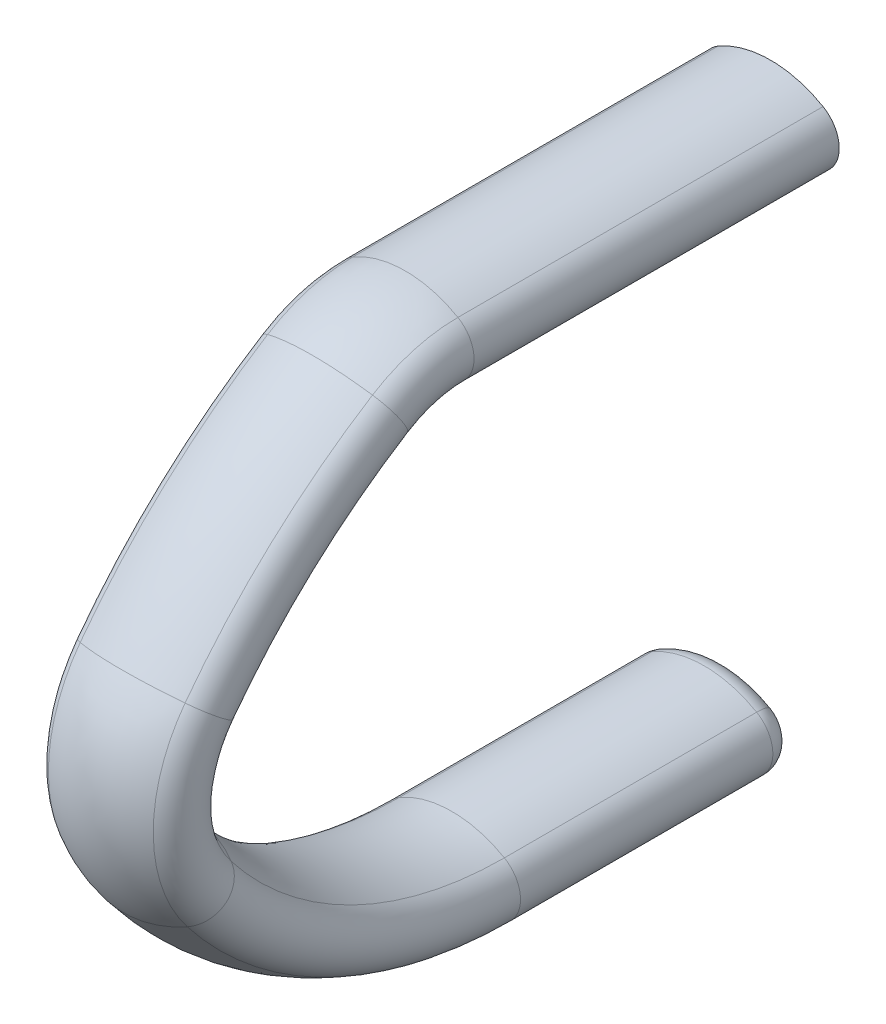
ISO-10303-21;
HEADER;
FILE_DESCRIPTION(('STEP AP214'),'2;1');
FILE_NAME('part.step','',(''),(''),'','','');
FILE_SCHEMA(('AUTOMOTIVE_DESIGN { 1 0 10303 214 1 1 1 1 }'));
ENDSEC;
DATA;
#1=APPLICATION_CONTEXT('core data for automotive mechanical design processes');
#2=APPLICATION_PROTOCOL_DEFINITION('international standard','automotive_design',2000,#1);
#3=PRODUCT_CONTEXT('',#1,'mechanical');
#4=PRODUCT('Part','Part','',(#3));
#5=PRODUCT_RELATED_PRODUCT_CATEGORY('part','',(#4));
#6=PRODUCT_DEFINITION_FORMATION('','',#4);
#7=PRODUCT_DEFINITION_CONTEXT('part definition',#1,'design');
#8=PRODUCT_DEFINITION('design','',#6,#7);
#9=PRODUCT_DEFINITION_SHAPE('','',#8);
#10=(LENGTH_UNIT() NAMED_UNIT(*) SI_UNIT(.MILLI.,.METRE.));
#11=(NAMED_UNIT(*) PLANE_ANGLE_UNIT() SI_UNIT($,.RADIAN.));
#12=(NAMED_UNIT(*) SI_UNIT($,.STERADIAN.) SOLID_ANGLE_UNIT());
#13=UNCERTAINTY_MEASURE_WITH_UNIT(LENGTH_MEASURE(1.E-05),#10,'distance_accuracy_value','');
#14=(GEOMETRIC_REPRESENTATION_CONTEXT(3) GLOBAL_UNCERTAINTY_ASSIGNED_CONTEXT((#13)) GLOBAL_UNIT_ASSIGNED_CONTEXT((#10,
#11,#12)) REPRESENTATION_CONTEXT('',''));
#15=CARTESIAN_POINT('',(0.,0.,0.));
#16=DIRECTION('',(0.,0.,1.));
#17=DIRECTION('',(1.,0.,0.));
#18=AXIS2_PLACEMENT_3D('',#15,#16,#17);
#19=CARTESIAN_POINT('',(0.,-193.607695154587,144.));
#20=DIRECTION('',(0.,0.,-1.));
#21=DIRECTION('',(-1.,0.,0.));
#22=AXIS2_PLACEMENT_3D('',#19,#20,#21);
#23=CYLINDRICAL_SURFACE('',#22,47.392304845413);
#24=DIRECTION('',(0.,0.,-1.));
#25=VECTOR('',#24,1.);
#26=CARTESIAN_POINT('',(-23.6961524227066,-234.650635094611,144.));
#27=LINE('',#26,#25);
#28=CARTESIAN_POINT('',(-23.6961524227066,-234.650635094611,144.));
#29=VERTEX_POINT('',#28);
#30=CARTESIAN_POINT('',(-23.6961524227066,-234.650635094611,30.));
#31=VERTEX_POINT('',#30);
#32=EDGE_CURVE('E730',#29,#31,#27,.T.);
#33=ORIENTED_EDGE('',*,*,#32,.T.);
#34=CARTESIAN_POINT('',(0.,-193.607695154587,30.));
#35=DIRECTION('',(0.,0.,1.));
#36=DIRECTION('',(0.,-1.,0.));
#37=AXIS2_PLACEMENT_3D('',#34,#35,#36);
#38=CIRCLE('',#37,47.392304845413);
#39=CARTESIAN_POINT('',(23.6961524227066,-234.650635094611,30.));
#40=VERTEX_POINT('',#39);
#41=EDGE_CURVE('E757',#31,#40,#38,.T.);
#42=ORIENTED_EDGE('',*,*,#41,.T.);
#43=DIRECTION('',(0.,0.,-1.));
#44=VECTOR('',#43,1.);
#45=CARTESIAN_POINT('',(23.6961524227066,-234.650635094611,144.));
#46=LINE('',#45,#44);
#47=CARTESIAN_POINT('',(23.6961524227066,-234.650635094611,144.));
#48=VERTEX_POINT('',#47);
#49=EDGE_CURVE('E718',#48,#40,#46,.T.);
#50=ORIENTED_EDGE('',*,*,#49,.F.);
#51=CARTESIAN_POINT('',(0.,-193.607695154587,144.));
#52=DIRECTION('',(0.,0.,-1.));
#53=DIRECTION('',(-1.,0.,0.));
#54=AXIS2_PLACEMENT_3D('',#51,#52,#53);
#55=CIRCLE('',#54,47.392304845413);
#56=EDGE_CURVE('E686',#48,#29,#55,.T.);
#57=ORIENTED_EDGE('',*,*,#56,.T.);
#58=EDGE_LOOP('',(#33,#42,#50,#57));
#59=FACE_BOUND('',#58,.T.);
#60=DIRECTION('',(0.,0.,-1.));
#61=VECTOR('',#60,1.);
#62=CARTESIAN_POINT('',(15.,-238.563568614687,144.));
#63=LINE('',#62,#61);
#64=CARTESIAN_POINT('',(15.,-238.563568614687,143.));
#65=VERTEX_POINT('',#64);
#66=CARTESIAN_POINT('',(15.,-238.563568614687,33.));
#67=VERTEX_POINT('',#66);
#68=EDGE_CURVE('E11',#65,#67,#63,.T.);
#69=ORIENTED_EDGE('',*,*,#68,.T.);
#70=CARTESIAN_POINT('',(0.,-193.607695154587,33.));
#71=DIRECTION('',(0.,0.,1.));
#72=DIRECTION('',(1.,0.,0.));
#73=AXIS2_PLACEMENT_3D('',#70,#71,#72);
#74=CIRCLE('',#73,47.392304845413);
#75=CARTESIAN_POINT('',(-15.,-238.563568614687,33.));
#76=VERTEX_POINT('',#75);
#77=EDGE_CURVE('E760',#67,#76,#74,.F.);
#78=ORIENTED_EDGE('',*,*,#77,.T.);
#79=DIRECTION('',(0.,0.,-1.));
#80=VECTOR('',#79,1.);
#81=CARTESIAN_POINT('',(-15.,-238.563568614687,144.));
#82=LINE('',#81,#80);
#83=CARTESIAN_POINT('',(-15.,-238.563568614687,143.));
#84=VERTEX_POINT('',#83);
#85=EDGE_CURVE('E57',#76,#84,#82,.F.);
#86=ORIENTED_EDGE('',*,*,#85,.T.);
#87=CARTESIAN_POINT('',(0.,-193.607695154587,143.));
#88=DIRECTION('',(0.,0.,-1.));
#89=DIRECTION('',(-1.,0.,0.));
#90=AXIS2_PLACEMENT_3D('',#87,#88,#89);
#91=CIRCLE('',#90,47.392304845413);
#92=EDGE_CURVE('E305',#84,#65,#91,.F.);
#93=ORIENTED_EDGE('',*,*,#92,.T.);
#94=EDGE_LOOP('',(#69,#78,#86,#93));
#95=FACE_BOUND('',#94,.T.);
#96=ADVANCED_FACE('F48',(#59,#95),#23,.T.);
#97=CARTESIAN_POINT('',(8.19615242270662,-14.1961524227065,0.));
#98=DIRECTION('',(0.,0.,-1.));
#99=DIRECTION('',(-1.,0.,0.));
#100=AXIS2_PLACEMENT_3D('',#97,#98,#99);
#101=PLANE('',#100);
#102=CARTESIAN_POINT('',(0.,-28.392304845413,0.));
#103=DIRECTION('',(0.,0.,1.));
#104=DIRECTION('',(-1.,0.,0.));
#105=AXIS2_PLACEMENT_3D('',#102,#103,#104);
#106=CIRCLE('',#105,47.392304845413);
#107=CARTESIAN_POINT('',(23.6961524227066,12.6506350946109,0.));
#108=VERTEX_POINT('',#107);
#109=CARTESIAN_POINT('',(-23.6961524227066,12.650635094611,0.));
#110=VERTEX_POINT('',#109);
#111=EDGE_CURVE('E562',#108,#110,#106,.T.);
#112=ORIENTED_EDGE('',*,*,#111,.F.);
#113=CARTESIAN_POINT('',(16.3923048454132,0.,0.));
#114=DIRECTION('',(0.,0.,1.));
#115=DIRECTION('',(-1.,0.,0.));
#116=AXIS2_PLACEMENT_3D('',#113,#114,#115);
#117=CIRCLE('',#116,14.6076951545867);
#118=CARTESIAN_POINT('',(23.6961524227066,-12.650635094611,0.));
#119=VERTEX_POINT('',#118);
#120=EDGE_CURVE('E549',#119,#108,#117,.T.);
#121=ORIENTED_EDGE('',*,*,#120,.F.);
#122=CARTESIAN_POINT('',(0.,28.392304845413,0.));
#123=DIRECTION('',(0.,0.,1.));
#124=DIRECTION('',(1.,0.,0.));
#125=AXIS2_PLACEMENT_3D('',#122,#123,#124);
#126=CIRCLE('',#125,47.392304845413);
#127=CARTESIAN_POINT('',(-23.6961524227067,-12.6506350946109,0.));
#128=VERTEX_POINT('',#127);
#129=EDGE_CURVE('E570',#128,#119,#126,.T.);
#130=ORIENTED_EDGE('',*,*,#129,.F.);
#131=CARTESIAN_POINT('',(-16.3923048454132,0.,0.));
#132=DIRECTION('',(0.,0.,1.));
#133=DIRECTION('',(1.,0.,0.));
#134=AXIS2_PLACEMENT_3D('',#131,#132,#133);
#135=CIRCLE('',#134,14.6076951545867);
#136=EDGE_CURVE('E566',#110,#128,#135,.T.);
#137=ORIENTED_EDGE('',*,*,#136,.F.);
#138=EDGE_LOOP('',(#112,#121,#130,#137));
#139=FACE_BOUND('',#138,.T.);
#140=CARTESIAN_POINT('',(16.3923048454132,0.,0.));
#141=DIRECTION('',(0.,0.,-1.));
#142=DIRECTION('',(-1.,0.,0.));
#143=AXIS2_PLACEMENT_3D('',#140,#141,#142);
#144=CIRCLE('',#143,9.10769515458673);
#145=CARTESIAN_POINT('',(20.9461524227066,-7.88749537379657,0.));
#146=VERTEX_POINT('',#145);
#147=CARTESIAN_POINT('',(20.9461524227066,7.88749537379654,0.));
#148=VERTEX_POINT('',#147);
#149=EDGE_CURVE('E498',#146,#148,#144,.F.);
#150=ORIENTED_EDGE('',*,*,#149,.T.);
#151=CARTESIAN_POINT('',(0.,-28.392304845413,0.));
#152=DIRECTION('',(0.,0.,-1.));
#153=DIRECTION('',(-1.,0.,0.));
#154=AXIS2_PLACEMENT_3D('',#151,#152,#153);
#155=CIRCLE('',#154,41.892304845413);
#156=CARTESIAN_POINT('',(-20.9461524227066,7.88749537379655,0.));
#157=VERTEX_POINT('',#156);
#158=EDGE_CURVE('E518',#148,#157,#155,.F.);
#159=ORIENTED_EDGE('',*,*,#158,.T.);
#160=CARTESIAN_POINT('',(-16.3923048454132,0.,0.));
#161=DIRECTION('',(0.,0.,-1.));
#162=DIRECTION('',(-1.,0.,0.));
#163=AXIS2_PLACEMENT_3D('',#160,#161,#162);
#164=CIRCLE('',#163,9.10769515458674);
#165=CARTESIAN_POINT('',(-20.9461524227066,-7.88749537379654,0.));
#166=VERTEX_POINT('',#165);
#167=EDGE_CURVE('E535',#157,#166,#164,.F.);
#168=ORIENTED_EDGE('',*,*,#167,.T.);
#169=CARTESIAN_POINT('',(0.,28.392304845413,0.));
#170=DIRECTION('',(0.,0.,-1.));
#171=DIRECTION('',(-1.,0.,0.));
#172=AXIS2_PLACEMENT_3D('',#169,#170,#171);
#173=CIRCLE('',#172,41.892304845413);
#174=EDGE_CURVE('E72',#166,#146,#173,.F.);
#175=ORIENTED_EDGE('',*,*,#174,.T.);
#176=EDGE_LOOP('',(#150,#159,#168,#175));
#177=FACE_BOUND('',#176,.T.);
#178=ADVANCED_FACE('F853',(#139,#177),#101,.T.);
#179=CARTESIAN_POINT('',(-16.3923048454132,-222.,144.));
#180=DIRECTION('',(0.,0.,-1.));
#181=DIRECTION('',(-1.,0.,0.));
#182=AXIS2_PLACEMENT_3D('',#179,#180,#181);
#183=CYLINDRICAL_SURFACE('',#182,14.6076951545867);
#184=DIRECTION('',(0.,0.,-1.));
#185=VECTOR('',#184,1.);
#186=CARTESIAN_POINT('',(-23.6961524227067,-209.349364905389,144.));
#187=LINE('',#186,#185);
#188=CARTESIAN_POINT('',(-23.6961524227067,-209.349364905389,144.));
#189=VERTEX_POINT('',#188);
#190=CARTESIAN_POINT('',(-23.6961524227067,-209.349364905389,30.));
#191=VERTEX_POINT('',#190);
#192=EDGE_CURVE('E726',#189,#191,#187,.T.);
#193=ORIENTED_EDGE('',*,*,#192,.T.);
#194=CARTESIAN_POINT('',(-16.3923048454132,-222.,30.));
#195=DIRECTION('',(0.,0.,1.));
#196=DIRECTION('',(0.,-1.,0.));
#197=AXIS2_PLACEMENT_3D('',#194,#195,#196);
#198=CIRCLE('',#197,14.6076951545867);
#199=EDGE_CURVE('E754',#191,#31,#198,.T.);
#200=ORIENTED_EDGE('',*,*,#199,.T.);
#201=ORIENTED_EDGE('',*,*,#32,.F.);
#202=CARTESIAN_POINT('',(-16.3923048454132,-222.,144.));
#203=DIRECTION('',(0.,0.,-1.));
#204=DIRECTION('',(1.,0.,0.));
#205=AXIS2_PLACEMENT_3D('',#202,#203,#204);
#206=CIRCLE('',#205,14.6076951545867);
#207=EDGE_CURVE('E698',#29,#189,#206,.T.);
#208=ORIENTED_EDGE('',*,*,#207,.T.);
#209=EDGE_LOOP('',(#193,#200,#201,#208));
#210=FACE_BOUND('',#209,.T.);
#211=ADVANCED_FACE('F859',(#210),#183,.T.);
#212=CARTESIAN_POINT('',(0.,-250.392304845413,144.));
#213=DIRECTION('',(0.,0.,-1.));
#214=DIRECTION('',(-1.,0.,0.));
#215=AXIS2_PLACEMENT_3D('',#212,#213,#214);
#216=CYLINDRICAL_SURFACE('',#215,47.392304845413);
#217=DIRECTION('',(0.,0.,-1.));
#218=VECTOR('',#217,1.);
#219=CARTESIAN_POINT('',(23.6961524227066,-209.349364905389,144.));
#220=LINE('',#219,#218);
#221=CARTESIAN_POINT('',(23.6961524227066,-209.349364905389,144.));
#222=VERTEX_POINT('',#221);
#223=CARTESIAN_POINT('',(23.6961524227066,-209.349364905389,30.));
#224=VERTEX_POINT('',#223);
#225=EDGE_CURVE('E722',#222,#224,#220,.T.);
#226=ORIENTED_EDGE('',*,*,#225,.T.);
#227=CARTESIAN_POINT('',(0.,-250.392304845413,29.9999999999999));
#228=DIRECTION('',(0.,0.,1.));
#229=DIRECTION('',(0.,-1.,0.));
#230=AXIS2_PLACEMENT_3D('',#227,#228,#229);
#231=CIRCLE('',#230,47.392304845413);
#232=EDGE_CURVE('E751',#224,#191,#231,.T.);
#233=ORIENTED_EDGE('',*,*,#232,.T.);
#234=ORIENTED_EDGE('',*,*,#192,.F.);
#235=CARTESIAN_POINT('',(0.,-250.392304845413,144.));
#236=DIRECTION('',(0.,0.,-1.));
#237=DIRECTION('',(1.,0.,0.));
#238=AXIS2_PLACEMENT_3D('',#235,#236,#237);
#239=CIRCLE('',#238,47.392304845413);
#240=EDGE_CURVE('E694',#189,#222,#239,.T.);
#241=ORIENTED_EDGE('',*,*,#240,.T.);
#242=EDGE_LOOP('',(#226,#233,#234,#241));
#243=FACE_BOUND('',#242,.T.);
#244=ADVANCED_FACE('F869',(#243),#216,.T.);
#245=CARTESIAN_POINT('',(16.3923048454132,-222.,144.));
#246=DIRECTION('',(0.,0.,-1.));
#247=DIRECTION('',(-1.,0.,0.));
#248=AXIS2_PLACEMENT_3D('',#245,#246,#247);
#249=CYLINDRICAL_SURFACE('',#248,14.6076951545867);
#250=ORIENTED_EDGE('',*,*,#49,.T.);
#251=CARTESIAN_POINT('',(16.3923048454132,-222.,30.));
#252=DIRECTION('',(0.,0.,1.));
#253=DIRECTION('',(0.,-1.,0.));
#254=AXIS2_PLACEMENT_3D('',#251,#252,#253);
#255=CIRCLE('',#254,14.6076951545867);
#256=EDGE_CURVE('E747',#40,#224,#255,.T.);
#257=ORIENTED_EDGE('',*,*,#256,.T.);
#258=ORIENTED_EDGE('',*,*,#225,.F.);
#259=CARTESIAN_POINT('',(16.3923048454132,-222.,144.));
#260=DIRECTION('',(0.,0.,-1.));
#261=DIRECTION('',(-1.,0.,0.));
#262=AXIS2_PLACEMENT_3D('',#259,#260,#261);
#263=CIRCLE('',#262,14.6076951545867);
#264=EDGE_CURVE('E690',#222,#48,#263,.T.);
#265=ORIENTED_EDGE('',*,*,#264,.T.);
#266=EDGE_LOOP('',(#250,#257,#258,#265));
#267=FACE_BOUND('',#266,.T.);
#268=ADVANCED_FACE('F866',(#267),#249,.T.);
#269=CARTESIAN_POINT('',(-16.3923048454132,-52.9523809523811,144.));
#270=DIRECTION('',(1.,0.,0.));
#271=DIRECTION('',(0.,0.,-1.));
#272=AXIS2_PLACEMENT_3D('',#269,#270,#271);
#273=TOROIDAL_SURFACE('',#272,169.047619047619,14.6076951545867);
#274=CARTESIAN_POINT('',(-16.3923048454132,-156.890829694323,277.318777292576));
#275=DIRECTION('',(0.,-0.788646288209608,-0.614847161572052));
#276=DIRECTION('',(1.,0.,0.));
#277=AXIS2_PLACEMENT_3D('',#274,#275,#276);
#278=CIRCLE('',#277,14.6076951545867);
#279=CARTESIAN_POINT('',(-23.6961524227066,-164.669036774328,287.295653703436));
#280=VERTEX_POINT('',#279);
#281=CARTESIAN_POINT('',(-23.6961524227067,-149.112622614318,267.341900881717));
#282=VERTEX_POINT('',#281);
#283=EDGE_CURVE('E666',#280,#282,#278,.T.);
#284=ORIENTED_EDGE('',*,*,#283,.T.);
#285=CARTESIAN_POINT('',(-23.6961524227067,-52.9523809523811,144.));
#286=DIRECTION('',(1.,0.,0.));
#287=DIRECTION('',(0.,0.,-1.));
#288=AXIS2_PLACEMENT_3D('',#285,#286,#287);
#289=CIRCLE('',#288,156.396983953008);
#290=EDGE_CURVE('E710',#282,#189,#289,.T.);
#291=ORIENTED_EDGE('',*,*,#290,.T.);
#292=ORIENTED_EDGE('',*,*,#207,.F.);
#293=CARTESIAN_POINT('',(-23.6961524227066,-52.9523809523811,144.));
#294=DIRECTION('',(1.,0.,0.));
#295=DIRECTION('',(0.,0.,-1.));
#296=AXIS2_PLACEMENT_3D('',#293,#294,#295);
#297=CIRCLE('',#296,181.69825414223);
#298=EDGE_CURVE('E714',#280,#29,#297,.T.);
#299=ORIENTED_EDGE('',*,*,#298,.F.);
#300=EDGE_LOOP('',(#284,#291,#292,#299));
#301=FACE_BOUND('',#300,.T.);
#302=ADVANCED_FACE('F864',(#301),#273,.T.);
#303=CARTESIAN_POINT('',(0.,-52.9523809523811,144.));
#304=DIRECTION('',(1.,0.,0.));
#305=DIRECTION('',(0.,0.,-1.));
#306=AXIS2_PLACEMENT_3D('',#303,#304,#305);
#307=TOROIDAL_SURFACE('',#306,197.439923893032,47.392304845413);
#308=CARTESIAN_POINT('',(0.,-174.347757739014,299.710263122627));
#309=DIRECTION('',(0.,-0.788646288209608,-0.614847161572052));
#310=DIRECTION('',(1.,0.,0.));
#311=AXIS2_PLACEMENT_3D('',#308,#309,#310);
#312=CIRCLE('',#311,47.392304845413);
#313=CARTESIAN_POINT('',(23.6961524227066,-149.112622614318,267.341900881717));
#314=VERTEX_POINT('',#313);
#315=EDGE_CURVE('E662',#282,#314,#312,.T.);
#316=ORIENTED_EDGE('',*,*,#315,.T.);
#317=CARTESIAN_POINT('',(23.6961524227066,-52.9523809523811,144.));
#318=DIRECTION('',(1.,0.,0.));
#319=DIRECTION('',(0.,0.,-1.));
#320=AXIS2_PLACEMENT_3D('',#317,#318,#319);
#321=CIRCLE('',#320,156.396983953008);
#322=EDGE_CURVE('E706',#314,#222,#321,.T.);
#323=ORIENTED_EDGE('',*,*,#322,.T.);
#324=ORIENTED_EDGE('',*,*,#240,.F.);
#325=ORIENTED_EDGE('',*,*,#290,.F.);
#326=EDGE_LOOP('',(#316,#323,#324,#325));
#327=FACE_BOUND('',#326,.T.);
#328=ADVANCED_FACE('F960',(#327),#307,.T.);
#329=CARTESIAN_POINT('',(16.3923048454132,-52.9523809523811,144.));
#330=DIRECTION('',(1.,0.,0.));
#331=DIRECTION('',(0.,0.,-1.));
#332=AXIS2_PLACEMENT_3D('',#329,#330,#331);
#333=TOROIDAL_SURFACE('',#332,169.047619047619,14.6076951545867);
#334=CARTESIAN_POINT('',(16.3923048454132,-156.890829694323,277.318777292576));
#335=DIRECTION('',(0.,-0.788646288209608,-0.614847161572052));
#336=DIRECTION('',(-1.,0.,0.));
#337=AXIS2_PLACEMENT_3D('',#334,#335,#336);
#338=CIRCLE('',#337,14.6076951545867);
#339=CARTESIAN_POINT('',(23.6961524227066,-164.669036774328,287.295653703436));
#340=VERTEX_POINT('',#339);
#341=EDGE_CURVE('E658',#314,#340,#338,.T.);
#342=ORIENTED_EDGE('',*,*,#341,.T.);
#343=CARTESIAN_POINT('',(23.6961524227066,-52.9523809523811,144.));
#344=DIRECTION('',(1.,0.,0.));
#345=DIRECTION('',(0.,0.,-1.));
#346=AXIS2_PLACEMENT_3D('',#343,#344,#345);
#347=CIRCLE('',#346,181.69825414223);
#348=EDGE_CURVE('E702',#340,#48,#347,.T.);
#349=ORIENTED_EDGE('',*,*,#348,.T.);
#350=ORIENTED_EDGE('',*,*,#264,.F.);
#351=ORIENTED_EDGE('',*,*,#322,.F.);
#352=EDGE_LOOP('',(#342,#349,#350,#351));
#353=FACE_BOUND('',#352,.T.);
#354=ADVANCED_FACE('F963',(#353),#333,.T.);
#355=CARTESIAN_POINT('',(0.,-52.9523809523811,144.));
#356=DIRECTION('',(1.,0.,0.));
#357=DIRECTION('',(0.,0.,-1.));
#358=AXIS2_PLACEMENT_3D('',#355,#356,#357);
#359=TOROIDAL_SURFACE('',#358,140.655314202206,47.392304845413);
#360=CARTESIAN_POINT('',(0.,-139.433901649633,254.927291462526));
#361=DIRECTION('',(0.,-0.788646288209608,-0.614847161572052));
#362=DIRECTION('',(-1.,0.,0.));
#363=AXIS2_PLACEMENT_3D('',#360,#361,#362);
#364=CIRCLE('',#363,47.392304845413);
#365=EDGE_CURVE('E654',#340,#280,#364,.T.);
#366=ORIENTED_EDGE('',*,*,#365,.T.);
#367=ORIENTED_EDGE('',*,*,#298,.T.);
#368=ORIENTED_EDGE('',*,*,#56,.F.);
#369=ORIENTED_EDGE('',*,*,#348,.F.);
#370=EDGE_LOOP('',(#366,#367,#368,#369));
#371=FACE_BOUND('',#370,.T.);
#372=ADVANCED_FACE('F904',(#371),#359,.T.);
#373=CARTESIAN_POINT('',(-16.3923048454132,-120.,230.));
#374=DIRECTION('',(1.,0.,0.));
#375=DIRECTION('',(0.,0.,-1.));
#376=AXIS2_PLACEMENT_3D('',#373,#374,#375);
#377=TOROIDAL_SURFACE('',#376,60.,14.6076951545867);
#378=CARTESIAN_POINT('',(-16.3923048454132,-84.1669370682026,278.124750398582));
#379=DIRECTION('',(0.,-0.802079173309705,0.597217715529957));
#380=DIRECTION('',(1.,0.,0.));
#381=AXIS2_PLACEMENT_3D('',#378,#379,#380);
#382=CIRCLE('',#381,14.6076951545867);
#383=CARTESIAN_POINT('',(-23.6961524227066,-76.6117536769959,288.271561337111));
#384=VERTEX_POINT('',#383);
#385=CARTESIAN_POINT('',(-23.6961524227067,-91.7221204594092,267.977939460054));
#386=VERTEX_POINT('',#385);
#387=EDGE_CURVE('E634',#384,#386,#382,.T.);
#388=ORIENTED_EDGE('',*,*,#387,.T.);
#389=CARTESIAN_POINT('',(-23.6961524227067,-120.,230.));
#390=DIRECTION('',(1.,0.,0.));
#391=DIRECTION('',(0.,0.,-1.));
#392=AXIS2_PLACEMENT_3D('',#389,#390,#391);
#393=CIRCLE('',#392,47.349364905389);
#394=EDGE_CURVE('E678',#386,#282,#393,.T.);
#395=ORIENTED_EDGE('',*,*,#394,.T.);
#396=ORIENTED_EDGE('',*,*,#283,.F.);
#397=CARTESIAN_POINT('',(-23.6961524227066,-120.,230.));
#398=DIRECTION('',(1.,0.,0.));
#399=DIRECTION('',(0.,0.,-1.));
#400=AXIS2_PLACEMENT_3D('',#397,#398,#399);
#401=CIRCLE('',#400,72.6506350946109);
#402=EDGE_CURVE('E682',#384,#280,#401,.T.);
#403=ORIENTED_EDGE('',*,*,#402,.F.);
#404=EDGE_LOOP('',(#388,#395,#396,#403));
#405=FACE_BOUND('',#404,.T.);
#406=ADVANCED_FACE('F909',(#405),#377,.T.);
#407=CARTESIAN_POINT('',(0.,-120.,230.));
#408=DIRECTION('',(1.,0.,0.));
#409=DIRECTION('',(0.,0.,-1.));
#410=AXIS2_PLACEMENT_3D('',#407,#408,#409);
#411=TOROIDAL_SURFACE('',#410,88.392304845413,47.392304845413);
#412=CARTESIAN_POINT('',(0.,-67.2105496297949,300.897626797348));
#413=DIRECTION('',(0.,-0.802079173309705,0.597217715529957));
#414=DIRECTION('',(1.,0.,0.));
#415=AXIS2_PLACEMENT_3D('',#412,#413,#414);
#416=CIRCLE('',#415,47.392304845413);
#417=CARTESIAN_POINT('',(23.6961524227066,-91.7221204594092,267.977939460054));
#418=VERTEX_POINT('',#417);
#419=EDGE_CURVE('E630',#386,#418,#416,.T.);
#420=ORIENTED_EDGE('',*,*,#419,.T.);
#421=CARTESIAN_POINT('',(23.6961524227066,-120.,230.));
#422=DIRECTION('',(1.,0.,0.));
#423=DIRECTION('',(0.,0.,-1.));
#424=AXIS2_PLACEMENT_3D('',#421,#422,#423);
#425=CIRCLE('',#424,47.349364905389);
#426=EDGE_CURVE('E674',#418,#314,#425,.T.);
#427=ORIENTED_EDGE('',*,*,#426,.T.);
#428=ORIENTED_EDGE('',*,*,#315,.F.);
#429=ORIENTED_EDGE('',*,*,#394,.F.);
#430=EDGE_LOOP('',(#420,#427,#428,#429));
#431=FACE_BOUND('',#430,.T.);
#432=ADVANCED_FACE('F958',(#431),#411,.T.);
#433=CARTESIAN_POINT('',(16.3923048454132,-120.,230.));
#434=DIRECTION('',(1.,0.,0.));
#435=DIRECTION('',(0.,0.,-1.));
#436=AXIS2_PLACEMENT_3D('',#433,#434,#435);
#437=TOROIDAL_SURFACE('',#436,60.,14.6076951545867);
#438=CARTESIAN_POINT('',(16.3923048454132,-84.1669370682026,278.124750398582));
#439=DIRECTION('',(0.,-0.802079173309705,0.597217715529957));
#440=DIRECTION('',(-1.,0.,0.));
#441=AXIS2_PLACEMENT_3D('',#438,#439,#440);
#442=CIRCLE('',#441,14.6076951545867);
#443=CARTESIAN_POINT('',(23.6961524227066,-76.6117536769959,288.271561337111));
#444=VERTEX_POINT('',#443);
#445=EDGE_CURVE('E626',#418,#444,#442,.T.);
#446=ORIENTED_EDGE('',*,*,#445,.T.);
#447=CARTESIAN_POINT('',(23.6961524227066,-120.,230.));
#448=DIRECTION('',(1.,0.,0.));
#449=DIRECTION('',(0.,0.,-1.));
#450=AXIS2_PLACEMENT_3D('',#447,#448,#449);
#451=CIRCLE('',#450,72.650635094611);
#452=EDGE_CURVE('E670',#444,#340,#451,.T.);
#453=ORIENTED_EDGE('',*,*,#452,.T.);
#454=ORIENTED_EDGE('',*,*,#341,.F.);
#455=ORIENTED_EDGE('',*,*,#426,.F.);
#456=EDGE_LOOP('',(#446,#453,#454,#455));
#457=FACE_BOUND('',#456,.T.);
#458=ADVANCED_FACE('F955',(#457),#437,.T.);
#459=CARTESIAN_POINT('',(0.,-120.,230.));
#460=DIRECTION('',(1.,0.,0.));
#461=DIRECTION('',(0.,0.,-1.));
#462=AXIS2_PLACEMENT_3D('',#459,#460,#461);
#463=DEGENERATE_TOROIDAL_SURFACE('',#462,31.607695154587,47.392304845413,.T.);
#464=CARTESIAN_POINT('',(0.,-101.12332450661,255.351873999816));
#465=DIRECTION('',(0.,-0.802079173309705,0.597217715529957));
#466=DIRECTION('',(-1.,0.,0.));
#467=AXIS2_PLACEMENT_3D('',#464,#465,#466);
#468=CIRCLE('',#467,47.392304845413);
#469=EDGE_CURVE('E622',#444,#384,#468,.T.);
#470=ORIENTED_EDGE('',*,*,#469,.T.);
#471=ORIENTED_EDGE('',*,*,#402,.T.);
#472=ORIENTED_EDGE('',*,*,#365,.F.);
#473=ORIENTED_EDGE('',*,*,#452,.F.);
#474=EDGE_LOOP('',(#470,#471,#472,#473));
#475=FACE_BOUND('',#474,.T.);
#476=ADVANCED_FACE('F911',(#475),#463,.T.);
#477=CARTESIAN_POINT('',(-16.3923048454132,-263.33225172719,37.5009984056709));
#478=DIRECTION('',(1.,0.,0.));
#479=DIRECTION('',(0.,0.,-1.));
#480=AXIS2_PLACEMENT_3D('',#477,#478,#479);
#481=TOROIDAL_SURFACE('',#480,300.,14.6076951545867);
#482=CARTESIAN_POINT('',(-16.3923048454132,-9.16693706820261,196.874750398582));
#483=DIRECTION('',(0.,-0.531245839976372,0.847217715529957));
#484=DIRECTION('',(1.,0.,0.));
#485=AXIS2_PLACEMENT_3D('',#482,#483,#484);
#486=CIRCLE('',#485,14.6076951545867);
#487=CARTESIAN_POINT('',(-23.6961524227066,1.55090509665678,203.595347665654));
#488=VERTEX_POINT('',#487);
#489=CARTESIAN_POINT('',(-23.6961524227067,-19.884779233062,190.154153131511));
#490=VERTEX_POINT('',#489);
#491=EDGE_CURVE('E602',#488,#490,#486,.T.);
#492=ORIENTED_EDGE('',*,*,#491,.T.);
#493=CARTESIAN_POINT('',(-23.6961524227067,-263.33225172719,37.5009984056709));
#494=DIRECTION('',(1.,0.,0.));
#495=DIRECTION('',(0.,0.,-1.));
#496=AXIS2_PLACEMENT_3D('',#493,#494,#495);
#497=CIRCLE('',#496,287.349364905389);
#498=EDGE_CURVE('E646',#490,#386,#497,.T.);
#499=ORIENTED_EDGE('',*,*,#498,.T.);
#500=ORIENTED_EDGE('',*,*,#387,.F.);
#501=CARTESIAN_POINT('',(-23.6961524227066,-263.33225172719,37.5009984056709));
#502=DIRECTION('',(1.,0.,0.));
#503=DIRECTION('',(0.,0.,-1.));
#504=AXIS2_PLACEMENT_3D('',#501,#502,#503);
#505=CIRCLE('',#504,312.650635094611);
#506=EDGE_CURVE('E650',#488,#384,#505,.T.);
#507=ORIENTED_EDGE('',*,*,#506,.F.);
#508=EDGE_LOOP('',(#492,#499,#500,#507));
#509=FACE_BOUND('',#508,.T.);
#510=ADVANCED_FACE('F916',(#509),#481,.T.);
#511=CARTESIAN_POINT('',(0.,-263.33225172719,37.5009984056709));
#512=DIRECTION('',(1.,0.,0.));
#513=DIRECTION('',(0.,0.,-1.));
#514=AXIS2_PLACEMENT_3D('',#511,#512,#513);
#515=TOROIDAL_SURFACE('',#514,328.392304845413,47.392304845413);
#516=CARTESIAN_POINT('',(0.,14.8875265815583,211.958044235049));
#517=DIRECTION('',(0.,-0.531245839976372,0.847217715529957));
#518=DIRECTION('',(1.,0.,0.));
#519=AXIS2_PLACEMENT_3D('',#516,#517,#518);
#520=CIRCLE('',#519,47.392304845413);
#521=CARTESIAN_POINT('',(23.6961524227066,-19.884779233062,190.154153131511));
#522=VERTEX_POINT('',#521);
#523=EDGE_CURVE('E598',#490,#522,#520,.T.);
#524=ORIENTED_EDGE('',*,*,#523,.T.);
#525=CARTESIAN_POINT('',(23.6961524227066,-263.33225172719,37.5009984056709));
#526=DIRECTION('',(1.,0.,0.));
#527=DIRECTION('',(0.,0.,-1.));
#528=AXIS2_PLACEMENT_3D('',#525,#526,#527);
#529=CIRCLE('',#528,287.349364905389);
#530=EDGE_CURVE('E642',#522,#418,#529,.T.);
#531=ORIENTED_EDGE('',*,*,#530,.T.);
#532=ORIENTED_EDGE('',*,*,#419,.F.);
#533=ORIENTED_EDGE('',*,*,#498,.F.);
#534=EDGE_LOOP('',(#524,#531,#532,#533));
#535=FACE_BOUND('',#534,.T.);
#536=ADVANCED_FACE('F948',(#535),#515,.T.);
#537=CARTESIAN_POINT('',(16.3923048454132,-263.33225172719,37.5009984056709));
#538=DIRECTION('',(1.,0.,0.));
#539=DIRECTION('',(0.,0.,-1.));
#540=AXIS2_PLACEMENT_3D('',#537,#538,#539);
#541=TOROIDAL_SURFACE('',#540,300.,14.6076951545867);
#542=CARTESIAN_POINT('',(16.3923048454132,-9.16693706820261,196.874750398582));
#543=DIRECTION('',(0.,-0.531245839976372,0.847217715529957));
#544=DIRECTION('',(-1.,0.,0.));
#545=AXIS2_PLACEMENT_3D('',#542,#543,#544);
#546=CIRCLE('',#545,14.6076951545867);
#547=CARTESIAN_POINT('',(23.6961524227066,1.55090509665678,203.595347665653));
#548=VERTEX_POINT('',#547);
#549=EDGE_CURVE('E594',#522,#548,#546,.T.);
#550=ORIENTED_EDGE('',*,*,#549,.T.);
#551=CARTESIAN_POINT('',(23.6961524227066,-263.33225172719,37.5009984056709));
#552=DIRECTION('',(1.,0.,0.));
#553=DIRECTION('',(0.,0.,-1.));
#554=AXIS2_PLACEMENT_3D('',#551,#552,#553);
#555=CIRCLE('',#554,312.650635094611);
#556=EDGE_CURVE('E638',#548,#444,#555,.T.);
#557=ORIENTED_EDGE('',*,*,#556,.T.);
#558=ORIENTED_EDGE('',*,*,#445,.F.);
#559=ORIENTED_EDGE('',*,*,#530,.F.);
#560=EDGE_LOOP('',(#550,#557,#558,#559));
#561=FACE_BOUND('',#560,.T.);
#562=ADVANCED_FACE('F952',(#561),#541,.T.);
#563=CARTESIAN_POINT('',(0.,-263.33225172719,37.5009984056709));
#564=DIRECTION('',(1.,0.,0.));
#565=DIRECTION('',(0.,0.,-1.));
#566=AXIS2_PLACEMENT_3D('',#563,#564,#565);
#567=TOROIDAL_SURFACE('',#566,271.607695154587,47.392304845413);
#568=CARTESIAN_POINT('',(0.,-33.2214007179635,181.791456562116));
#569=DIRECTION('',(0.,-0.531245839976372,0.847217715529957));
#570=DIRECTION('',(-1.,0.,0.));
#571=AXIS2_PLACEMENT_3D('',#568,#569,#570);
#572=CIRCLE('',#571,47.392304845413);
#573=EDGE_CURVE('E590',#548,#488,#572,.T.);
#574=ORIENTED_EDGE('',*,*,#573,.T.);
#575=ORIENTED_EDGE('',*,*,#506,.T.);
#576=ORIENTED_EDGE('',*,*,#469,.F.);
#577=ORIENTED_EDGE('',*,*,#556,.F.);
#578=EDGE_LOOP('',(#574,#575,#576,#577));
#579=FACE_BOUND('',#578,.T.);
#580=ADVANCED_FACE('F918',(#579),#567,.T.);
#581=CARTESIAN_POINT('',(-16.3923048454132,-60.,165.));
#582=DIRECTION('',(1.,0.,0.));
#583=DIRECTION('',(0.,0.,-1.));
#584=AXIS2_PLACEMENT_3D('',#581,#582,#583);
#585=TOROIDAL_SURFACE('',#584,60.,14.6076951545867);
#586=CARTESIAN_POINT('',(-16.3923048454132,0.,165.));
#587=DIRECTION('',(0.,0.,1.));
#588=DIRECTION('',(1.,0.,0.));
#589=AXIS2_PLACEMENT_3D('',#586,#587,#588);
#590=CIRCLE('',#589,14.6076951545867);
#591=CARTESIAN_POINT('',(-23.6961524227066,12.6506350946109,165.));
#592=VERTEX_POINT('',#591);
#593=CARTESIAN_POINT('',(-23.6961524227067,-12.650635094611,165.));
#594=VERTEX_POINT('',#593);
#595=EDGE_CURVE('E548',#592,#594,#590,.T.);
#596=ORIENTED_EDGE('',*,*,#595,.T.);
#597=CARTESIAN_POINT('',(-23.6961524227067,-60.,165.));
#598=DIRECTION('',(1.,0.,0.));
#599=DIRECTION('',(0.,0.,-1.));
#600=AXIS2_PLACEMENT_3D('',#597,#598,#599);
#601=CIRCLE('',#600,47.349364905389);
#602=EDGE_CURVE('E614',#594,#490,#601,.T.);
#603=ORIENTED_EDGE('',*,*,#602,.T.);
#604=ORIENTED_EDGE('',*,*,#491,.F.);
#605=CARTESIAN_POINT('',(-23.6961524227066,-60.,165.));
#606=DIRECTION('',(1.,0.,0.));
#607=DIRECTION('',(0.,0.,-1.));
#608=AXIS2_PLACEMENT_3D('',#605,#606,#607);
#609=CIRCLE('',#608,72.6506350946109);
#610=EDGE_CURVE('E618',#592,#488,#609,.T.);
#611=ORIENTED_EDGE('',*,*,#610,.F.);
#612=EDGE_LOOP('',(#596,#603,#604,#611));
#613=FACE_BOUND('',#612,.T.);
#614=ADVANCED_FACE('F923',(#613),#585,.T.);
#615=CARTESIAN_POINT('',(0.,-60.,165.));
#616=DIRECTION('',(1.,0.,0.));
#617=DIRECTION('',(0.,0.,-1.));
#618=AXIS2_PLACEMENT_3D('',#615,#616,#617);
#619=TOROIDAL_SURFACE('',#618,88.3923048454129,47.392304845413);
#620=CARTESIAN_POINT('',(0.,28.3923048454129,165.));
#621=DIRECTION('',(0.,0.,1.));
#622=DIRECTION('',(1.,0.,0.));
#623=AXIS2_PLACEMENT_3D('',#620,#621,#622);
#624=CIRCLE('',#623,47.392304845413);
#625=CARTESIAN_POINT('',(23.6961524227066,-12.650635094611,165.));
#626=VERTEX_POINT('',#625);
#627=EDGE_CURVE('E553',#594,#626,#624,.T.);
#628=ORIENTED_EDGE('',*,*,#627,.T.);
#629=CARTESIAN_POINT('',(23.6961524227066,-60.,165.));
#630=DIRECTION('',(1.,0.,0.));
#631=DIRECTION('',(0.,0.,-1.));
#632=AXIS2_PLACEMENT_3D('',#629,#630,#631);
#633=CIRCLE('',#632,47.349364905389);
#634=EDGE_CURVE('E610',#626,#522,#633,.T.);
#635=ORIENTED_EDGE('',*,*,#634,.T.);
#636=ORIENTED_EDGE('',*,*,#523,.F.);
#637=ORIENTED_EDGE('',*,*,#602,.F.);
#638=EDGE_LOOP('',(#628,#635,#636,#637));
#639=FACE_BOUND('',#638,.T.);
#640=ADVANCED_FACE('F945',(#639),#619,.T.);
#641=CARTESIAN_POINT('',(16.3923048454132,-60.,165.));
#642=DIRECTION('',(1.,0.,0.));
#643=DIRECTION('',(0.,0.,-1.));
#644=AXIS2_PLACEMENT_3D('',#641,#642,#643);
#645=TOROIDAL_SURFACE('',#644,60.,14.6076951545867);
#646=CARTESIAN_POINT('',(16.3923048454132,0.,165.));
#647=DIRECTION('',(0.,0.,1.));
#648=DIRECTION('',(-1.,0.,0.));
#649=AXIS2_PLACEMENT_3D('',#646,#647,#648);
#650=CIRCLE('',#649,14.6076951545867);
#651=CARTESIAN_POINT('',(23.6961524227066,12.6506350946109,165.));
#652=VERTEX_POINT('',#651);
#653=EDGE_CURVE('E557',#626,#652,#650,.T.);
#654=ORIENTED_EDGE('',*,*,#653,.T.);
#655=CARTESIAN_POINT('',(23.6961524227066,-60.,165.));
#656=DIRECTION('',(1.,0.,0.));
#657=DIRECTION('',(0.,0.,-1.));
#658=AXIS2_PLACEMENT_3D('',#655,#656,#657);
#659=CIRCLE('',#658,72.6506350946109);
#660=EDGE_CURVE('E606',#652,#548,#659,.T.);
#661=ORIENTED_EDGE('',*,*,#660,.T.);
#662=ORIENTED_EDGE('',*,*,#549,.F.);
#663=ORIENTED_EDGE('',*,*,#634,.F.);
#664=EDGE_LOOP('',(#654,#661,#662,#663));
#665=FACE_BOUND('',#664,.T.);
#666=ADVANCED_FACE('F950',(#665),#645,.T.);
#667=CARTESIAN_POINT('',(0.,-60.,165.));
#668=DIRECTION('',(1.,0.,0.));
#669=DIRECTION('',(0.,0.,-1.));
#670=AXIS2_PLACEMENT_3D('',#667,#668,#669);
#671=DEGENERATE_TOROIDAL_SURFACE('',#670,31.607695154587,47.392304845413,.T.);
#672=CARTESIAN_POINT('',(0.,-28.392304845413,165.));
#673=DIRECTION('',(0.,0.,1.));
#674=DIRECTION('',(-1.,0.,0.));
#675=AXIS2_PLACEMENT_3D('',#672,#673,#674);
#676=CIRCLE('',#675,47.392304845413);
#677=EDGE_CURVE('E544',#652,#592,#676,.T.);
#678=ORIENTED_EDGE('',*,*,#677,.T.);
#679=ORIENTED_EDGE('',*,*,#610,.T.);
#680=ORIENTED_EDGE('',*,*,#573,.F.);
#681=ORIENTED_EDGE('',*,*,#660,.F.);
#682=EDGE_LOOP('',(#678,#679,#680,#681));
#683=FACE_BOUND('',#682,.T.);
#684=ADVANCED_FACE('F925',(#683),#671,.T.);
#685=CARTESIAN_POINT('',(0.,-28.392304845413,165.));
#686=DIRECTION('',(0.,0.,-1.));
#687=DIRECTION('',(0.,1.,0.));
#688=AXIS2_PLACEMENT_3D('',#685,#686,#687);
#689=CYLINDRICAL_SURFACE('',#688,47.392304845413);
#690=ORIENTED_EDGE('',*,*,#111,.T.);
#691=DIRECTION('',(0.,0.,-1.));
#692=VECTOR('',#691,1.);
#693=CARTESIAN_POINT('',(-23.6961524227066,12.6506350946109,165.));
#694=LINE('',#693,#692);
#695=EDGE_CURVE('E586',#592,#110,#694,.T.);
#696=ORIENTED_EDGE('',*,*,#695,.F.);
#697=ORIENTED_EDGE('',*,*,#677,.F.);
#698=DIRECTION('',(0.,0.,-1.));
#699=VECTOR('',#698,1.);
#700=CARTESIAN_POINT('',(23.6961524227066,12.6506350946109,165.));
#701=LINE('',#700,#699);
#702=EDGE_CURVE('E561',#652,#108,#701,.T.);
#703=ORIENTED_EDGE('',*,*,#702,.T.);
#704=EDGE_LOOP('',(#690,#696,#697,#703));
#705=FACE_BOUND('',#704,.T.);
#706=ADVANCED_FACE('F934',(#705),#689,.T.);
#707=CARTESIAN_POINT('',(-16.3923048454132,0.,165.));
#708=DIRECTION('',(0.,0.,-1.));
#709=DIRECTION('',(0.,1.,0.));
#710=AXIS2_PLACEMENT_3D('',#707,#708,#709);
#711=CYLINDRICAL_SURFACE('',#710,14.6076951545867);
#712=ORIENTED_EDGE('',*,*,#136,.T.);
#713=DIRECTION('',(0.,0.,-1.));
#714=VECTOR('',#713,1.);
#715=CARTESIAN_POINT('',(-23.6961524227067,-12.650635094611,165.));
#716=LINE('',#715,#714);
#717=EDGE_CURVE('E582',#594,#128,#716,.T.);
#718=ORIENTED_EDGE('',*,*,#717,.F.);
#719=ORIENTED_EDGE('',*,*,#595,.F.);
#720=ORIENTED_EDGE('',*,*,#695,.T.);
#721=EDGE_LOOP('',(#712,#718,#719,#720));
#722=FACE_BOUND('',#721,.T.);
#723=ADVANCED_FACE('F932',(#722),#711,.T.);
#724=CARTESIAN_POINT('',(0.,28.3923048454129,165.));
#725=DIRECTION('',(0.,0.,-1.));
#726=DIRECTION('',(0.,1.,0.));
#727=AXIS2_PLACEMENT_3D('',#724,#725,#726);
#728=CYLINDRICAL_SURFACE('',#727,47.392304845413);
#729=ORIENTED_EDGE('',*,*,#129,.T.);
#730=DIRECTION('',(0.,0.,-1.));
#731=VECTOR('',#730,1.);
#732=CARTESIAN_POINT('',(23.6961524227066,-12.650635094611,165.));
#733=LINE('',#732,#731);
#734=EDGE_CURVE('E578',#626,#119,#733,.T.);
#735=ORIENTED_EDGE('',*,*,#734,.F.);
#736=ORIENTED_EDGE('',*,*,#627,.F.);
#737=ORIENTED_EDGE('',*,*,#717,.T.);
#738=EDGE_LOOP('',(#729,#735,#736,#737));
#739=FACE_BOUND('',#738,.T.);
#740=ADVANCED_FACE('F941',(#739),#728,.T.);
#741=CARTESIAN_POINT('',(16.3923048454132,0.,165.));
#742=DIRECTION('',(0.,0.,-1.));
#743=DIRECTION('',(0.,1.,0.));
#744=AXIS2_PLACEMENT_3D('',#741,#742,#743);
#745=CYLINDRICAL_SURFACE('',#744,14.6076951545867);
#746=ORIENTED_EDGE('',*,*,#120,.T.);
#747=ORIENTED_EDGE('',*,*,#702,.F.);
#748=ORIENTED_EDGE('',*,*,#653,.F.);
#749=ORIENTED_EDGE('',*,*,#734,.T.);
#750=EDGE_LOOP('',(#746,#747,#748,#749));
#751=FACE_BOUND('',#750,.T.);
#752=ADVANCED_FACE('F970',(#751),#745,.T.);
#753=CARTESIAN_POINT('',(8.19615242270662,-207.803847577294,20.));
#754=DIRECTION('',(0.,0.,1.));
#755=DIRECTION('',(-1.,0.,0.));
#756=AXIS2_PLACEMENT_3D('',#753,#754,#755);
#757=PLANE('',#756);
#758=CARTESIAN_POINT('',(0.,-250.392304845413,20.));
#759=DIRECTION('',(0.,0.,1.));
#760=DIRECTION('',(0.,-1.,0.));
#761=AXIS2_PLACEMENT_3D('',#758,#759,#760);
#762=CIRCLE('',#761,37.392304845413);
#763=CARTESIAN_POINT('',(-18.6961524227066,-218.009618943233,20.));
#764=VERTEX_POINT('',#763);
#765=CARTESIAN_POINT('',(18.6961524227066,-218.009618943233,20.));
#766=VERTEX_POINT('',#765);
#767=EDGE_CURVE('E740',#764,#766,#762,.F.);
#768=ORIENTED_EDGE('',*,*,#767,.T.);
#769=CARTESIAN_POINT('',(16.3923048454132,-222.,20.));
#770=DIRECTION('',(0.,0.,1.));
#771=DIRECTION('',(0.,-1.,0.));
#772=AXIS2_PLACEMENT_3D('',#769,#770,#771);
#773=CIRCLE('',#772,4.60769515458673);
#774=CARTESIAN_POINT('',(18.6961524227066,-225.990381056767,20.));
#775=VERTEX_POINT('',#774);
#776=EDGE_CURVE('E743',#766,#775,#773,.F.);
#777=ORIENTED_EDGE('',*,*,#776,.T.);
#778=CARTESIAN_POINT('',(0.,-193.607695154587,20.));
#779=DIRECTION('',(0.,0.,1.));
#780=DIRECTION('',(0.,-1.,0.));
#781=AXIS2_PLACEMENT_3D('',#778,#779,#780);
#782=CIRCLE('',#781,37.392304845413);
#783=CARTESIAN_POINT('',(-18.6961524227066,-225.990381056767,20.));
#784=VERTEX_POINT('',#783);
#785=EDGE_CURVE('E734',#775,#784,#782,.F.);
#786=ORIENTED_EDGE('',*,*,#785,.T.);
#787=CARTESIAN_POINT('',(-16.3923048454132,-222.,20.));
#788=DIRECTION('',(0.,0.,1.));
#789=DIRECTION('',(0.,-1.,0.));
#790=AXIS2_PLACEMENT_3D('',#787,#788,#789);
#791=CIRCLE('',#790,4.60769515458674);
#792=EDGE_CURVE('E737',#784,#764,#791,.F.);
#793=ORIENTED_EDGE('',*,*,#792,.T.);
#794=EDGE_LOOP('',(#768,#777,#786,#793));
#795=FACE_BOUND('',#794,.T.);
#796=ADVANCED_FACE('F889',(#795),#757,.F.);
#797=CARTESIAN_POINT('',(-16.3923048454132,-222.,30.));
#798=DIRECTION('',(0.,0.,1.));
#799=DIRECTION('',(0.,-1.,0.));
#800=AXIS2_PLACEMENT_3D('',#797,#798,#799);
#801=DEGENERATE_TOROIDAL_SURFACE('',#800,4.60769515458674,10.,.T.);
#802=CARTESIAN_POINT('',(-18.6961524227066,-225.990381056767,29.9999999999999));
#803=DIRECTION('',(0.866025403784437,-0.500000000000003,0.));
#804=DIRECTION('',(0.500000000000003,0.866025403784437,0.));
#805=AXIS2_PLACEMENT_3D('',#802,#803,#804);
#806=CIRCLE('',#805,10.);
#807=EDGE_CURVE('E766',#31,#784,#806,.T.);
#808=ORIENTED_EDGE('',*,*,#807,.F.);
#809=ORIENTED_EDGE('',*,*,#199,.F.);
#810=CARTESIAN_POINT('',(-18.6961524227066,-218.009618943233,30.));
#811=DIRECTION('',(0.866025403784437,0.500000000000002,0.));
#812=DIRECTION('',(-0.500000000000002,0.866025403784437,0.));
#813=AXIS2_PLACEMENT_3D('',#810,#811,#812);
#814=CIRCLE('',#813,10.);
#815=EDGE_CURVE('E567',#764,#191,#814,.T.);
#816=ORIENTED_EDGE('',*,*,#815,.F.);
#817=ORIENTED_EDGE('',*,*,#792,.F.);
#818=EDGE_LOOP('',(#808,#809,#816,#817));
#819=FACE_BOUND('',#818,.T.);
#820=ADVANCED_FACE('F50',(#819),#801,.T.);
#821=CARTESIAN_POINT('',(0.,-250.392304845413,29.9999999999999));
#822=DIRECTION('',(0.,0.,1.));
#823=DIRECTION('',(0.,-1.,0.));
#824=AXIS2_PLACEMENT_3D('',#821,#822,#823);
#825=TOROIDAL_SURFACE('',#824,37.392304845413,10.);
#826=ORIENTED_EDGE('',*,*,#815,.T.);
#827=ORIENTED_EDGE('',*,*,#232,.F.);
#828=CARTESIAN_POINT('',(18.6961524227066,-218.009618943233,30.));
#829=DIRECTION('',(0.86602540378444,-0.499999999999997,0.));
#830=DIRECTION('',(0.499999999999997,0.86602540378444,0.));
#831=AXIS2_PLACEMENT_3D('',#828,#829,#830);
#832=CIRCLE('',#831,10.);
#833=EDGE_CURVE('E763',#766,#224,#832,.T.);
#834=ORIENTED_EDGE('',*,*,#833,.F.);
#835=ORIENTED_EDGE('',*,*,#767,.F.);
#836=EDGE_LOOP('',(#826,#827,#834,#835));
#837=FACE_BOUND('',#836,.T.);
#838=ADVANCED_FACE('F882',(#837),#825,.T.);
#839=CARTESIAN_POINT('',(0.,-193.607695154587,30.));
#840=DIRECTION('',(0.,0.,1.));
#841=DIRECTION('',(0.,-1.,0.));
#842=AXIS2_PLACEMENT_3D('',#839,#840,#841);
#843=TOROIDAL_SURFACE('',#842,37.392304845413,10.);
#844=ORIENTED_EDGE('',*,*,#807,.T.);
#845=ORIENTED_EDGE('',*,*,#785,.F.);
#846=CARTESIAN_POINT('',(18.6961524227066,-225.990381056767,30.));
#847=DIRECTION('',(0.866025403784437,0.500000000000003,0.));
#848=DIRECTION('',(-0.500000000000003,0.866025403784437,0.));
#849=AXIS2_PLACEMENT_3D('',#846,#847,#848);
#850=CIRCLE('',#849,10.);
#851=EDGE_CURVE('E366',#40,#775,#850,.T.);
#852=ORIENTED_EDGE('',*,*,#851,.F.);
#853=ORIENTED_EDGE('',*,*,#41,.F.);
#854=EDGE_LOOP('',(#844,#845,#852,#853));
#855=FACE_BOUND('',#854,.T.);
#856=ADVANCED_FACE('F879',(#855),#843,.T.);
#857=CARTESIAN_POINT('',(16.3923048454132,-222.,30.));
#858=DIRECTION('',(0.,0.,1.));
#859=DIRECTION('',(0.,-1.,0.));
#860=AXIS2_PLACEMENT_3D('',#857,#858,#859);
#861=DEGENERATE_TOROIDAL_SURFACE('',#860,4.60769515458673,10.,.T.);
#862=ORIENTED_EDGE('',*,*,#833,.T.);
#863=ORIENTED_EDGE('',*,*,#256,.F.);
#864=ORIENTED_EDGE('',*,*,#851,.T.);
#865=ORIENTED_EDGE('',*,*,#776,.F.);
#866=EDGE_LOOP('',(#862,#863,#864,#865));
#867=FACE_BOUND('',#866,.T.);
#868=ADVANCED_FACE('F840',(#867),#861,.T.);
#869=CARTESIAN_POINT('',(-16.3923048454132,-222.,144.));
#870=DIRECTION('',(0.,0.,-1.));
#871=DIRECTION('',(-1.,0.,0.));
#872=AXIS2_PLACEMENT_3D('',#869,#870,#871);
#873=CYLINDRICAL_SURFACE('',#872,9.10769515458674);
#874=DIRECTION('',(0.,0.,-1.));
#875=VECTOR('',#874,1.);
#876=CARTESIAN_POINT('',(-20.9461524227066,-214.112504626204,144.));
#877=LINE('',#876,#875);
#878=CARTESIAN_POINT('',(-20.9461524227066,-214.112504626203,144.));
#879=VERTEX_POINT('',#878);
#880=CARTESIAN_POINT('',(-20.9461524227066,-214.112504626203,30.));
#881=VERTEX_POINT('',#880);
#882=EDGE_CURVE('E320',#879,#881,#877,.T.);
#883=ORIENTED_EDGE('',*,*,#882,.F.);
#884=CARTESIAN_POINT('',(-16.3923048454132,-222.,144.));
#885=DIRECTION('',(0.,0.,-1.));
#886=DIRECTION('',(-1.,0.,0.));
#887=AXIS2_PLACEMENT_3D('',#884,#885,#886);
#888=CIRCLE('',#887,9.10769515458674);
#889=CARTESIAN_POINT('',(-20.9461524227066,-229.887495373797,144.));
#890=VERTEX_POINT('',#889);
#891=EDGE_CURVE('E335',#890,#879,#888,.T.);
#892=ORIENTED_EDGE('',*,*,#891,.F.);
#893=DIRECTION('',(0.,0.,-1.));
#894=VECTOR('',#893,1.);
#895=CARTESIAN_POINT('',(-20.9461524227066,-229.887495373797,144.));
#896=LINE('',#895,#894);
#897=CARTESIAN_POINT('',(-20.9461524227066,-229.887495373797,30.));
#898=VERTEX_POINT('',#897);
#899=EDGE_CURVE('E324',#890,#898,#896,.T.);
#900=ORIENTED_EDGE('',*,*,#899,.T.);
#901=CARTESIAN_POINT('',(-16.3923048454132,-222.,30.));
#902=DIRECTION('',(0.,0.,-1.));
#903=DIRECTION('',(-1.,0.,0.));
#904=AXIS2_PLACEMENT_3D('',#901,#902,#903);
#905=CIRCLE('',#904,9.10769515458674);
#906=EDGE_CURVE('E326',#881,#898,#905,.F.);
#907=ORIENTED_EDGE('',*,*,#906,.F.);
#908=EDGE_LOOP('',(#883,#892,#900,#907));
#909=FACE_BOUND('',#908,.T.);
#910=ADVANCED_FACE('F836',(#909),#873,.F.);
#911=CARTESIAN_POINT('',(0.,-250.392304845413,144.));
#912=DIRECTION('',(0.,0.,-1.));
#913=DIRECTION('',(-1.,0.,0.));
#914=AXIS2_PLACEMENT_3D('',#911,#912,#913);
#915=CYLINDRICAL_SURFACE('',#914,41.892304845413);
#916=DIRECTION('',(0.,0.,-1.));
#917=VECTOR('',#916,1.);
#918=CARTESIAN_POINT('',(20.9461524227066,-214.112504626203,144.));
#919=LINE('',#918,#917);
#920=CARTESIAN_POINT('',(20.9461524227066,-214.112504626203,144.));
#921=VERTEX_POINT('',#920);
#922=CARTESIAN_POINT('',(20.9461524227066,-214.112504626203,30.));
#923=VERTEX_POINT('',#922);
#924=EDGE_CURVE('E325',#921,#923,#919,.T.);
#925=ORIENTED_EDGE('',*,*,#924,.F.);
#926=CARTESIAN_POINT('',(0.,-250.392304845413,144.));
#927=DIRECTION('',(0.,0.,-1.));
#928=DIRECTION('',(-1.,0.,0.));
#929=AXIS2_PLACEMENT_3D('',#926,#927,#928);
#930=CIRCLE('',#929,41.892304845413);
#931=EDGE_CURVE('E340',#879,#921,#930,.T.);
#932=ORIENTED_EDGE('',*,*,#931,.F.);
#933=ORIENTED_EDGE('',*,*,#882,.T.);
#934=CARTESIAN_POINT('',(0.,-250.392304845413,30.));
#935=DIRECTION('',(0.,0.,-1.));
#936=DIRECTION('',(-1.,0.,0.));
#937=AXIS2_PLACEMENT_3D('',#934,#935,#936);
#938=CIRCLE('',#937,41.892304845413);
#939=EDGE_CURVE('E330',#923,#881,#938,.F.);
#940=ORIENTED_EDGE('',*,*,#939,.F.);
#941=EDGE_LOOP('',(#925,#932,#933,#940));
#942=FACE_BOUND('',#941,.T.);
#943=ADVANCED_FACE('F839',(#942),#915,.F.);
#944=CARTESIAN_POINT('',(16.3923048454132,-222.,144.));
#945=DIRECTION('',(0.,0.,-1.));
#946=DIRECTION('',(-1.,0.,0.));
#947=AXIS2_PLACEMENT_3D('',#944,#945,#946);
#948=CYLINDRICAL_SURFACE('',#947,9.10769515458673);
#949=DIRECTION('',(0.,0.,-1.));
#950=VECTOR('',#949,1.);
#951=CARTESIAN_POINT('',(20.9461524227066,-229.887495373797,144.));
#952=LINE('',#951,#950);
#953=CARTESIAN_POINT('',(20.9461524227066,-229.887495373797,144.));
#954=VERTEX_POINT('',#953);
#955=CARTESIAN_POINT('',(20.9461524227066,-229.887495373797,30.));
#956=VERTEX_POINT('',#955);
#957=EDGE_CURVE('E344',#954,#956,#952,.T.);
#958=ORIENTED_EDGE('',*,*,#957,.F.);
#959=CARTESIAN_POINT('',(16.3923048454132,-222.,144.));
#960=DIRECTION('',(0.,0.,-1.));
#961=DIRECTION('',(-1.,0.,0.));
#962=AXIS2_PLACEMENT_3D('',#959,#960,#961);
#963=CIRCLE('',#962,9.10769515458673);
#964=EDGE_CURVE('E351',#921,#954,#963,.T.);
#965=ORIENTED_EDGE('',*,*,#964,.F.);
#966=ORIENTED_EDGE('',*,*,#924,.T.);
#967=CARTESIAN_POINT('',(16.3923048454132,-222.,30.));
#968=DIRECTION('',(0.,0.,-1.));
#969=DIRECTION('',(-1.,0.,0.));
#970=AXIS2_PLACEMENT_3D('',#967,#968,#969);
#971=CIRCLE('',#970,9.10769515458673);
#972=EDGE_CURVE('E347',#956,#923,#971,.F.);
#973=ORIENTED_EDGE('',*,*,#972,.F.);
#974=EDGE_LOOP('',(#958,#965,#966,#973));
#975=FACE_BOUND('',#974,.T.);
#976=ADVANCED_FACE('F843',(#975),#948,.F.);
#977=CARTESIAN_POINT('',(0.,-193.607695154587,144.));
#978=DIRECTION('',(0.,0.,-1.));
#979=DIRECTION('',(-1.,0.,0.));
#980=AXIS2_PLACEMENT_3D('',#977,#978,#979);
#981=CYLINDRICAL_SURFACE('',#980,41.892304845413);
#982=CARTESIAN_POINT('',(0.,-235.5,125.));
#983=CARTESIAN_POINT('',(0.168279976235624,-235.499998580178,125.000007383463));
#984=CARTESIAN_POINT('',(0.336676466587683,-235.498975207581,125.014206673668));
#985=CARTESIAN_POINT('',(0.668815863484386,-235.494991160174,125.070644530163));
#986=CARTESIAN_POINT('',(0.832553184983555,-235.492028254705,125.112915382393));
#987=CARTESIAN_POINT('',(1.15051537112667,-235.484500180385,125.224272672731));
#988=CARTESIAN_POINT('',(1.30474534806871,-235.479935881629,125.293344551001));
#989=CARTESIAN_POINT('',(1.59938322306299,-235.469717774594,125.45631857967));
#990=CARTESIAN_POINT('',(1.73979419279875,-235.464064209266,125.550215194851));
#991=CARTESIAN_POINT('',(2.00311699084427,-235.452290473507,125.760369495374));
#992=CARTESIAN_POINT('',(2.12599868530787,-235.446169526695,125.876664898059));
#993=CARTESIAN_POINT('',(2.35051664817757,-235.434157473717,126.128236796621));
#994=CARTESIAN_POINT('',(2.45215201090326,-235.428266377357,126.263514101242));
#995=CARTESIAN_POINT('',(2.63138975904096,-235.417372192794,126.549386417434));
#996=CARTESIAN_POINT('',(2.70896637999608,-235.41237005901,126.699997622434));
#997=CARTESIAN_POINT('',(2.8377198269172,-235.403828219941,127.01214920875));
#998=CARTESIAN_POINT('',(2.88889700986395,-235.40028849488,127.173689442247));
#999=CARTESIAN_POINT('',(2.96331329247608,-235.395078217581,127.502817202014));
#1000=CARTESIAN_POINT('',(2.98660057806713,-235.393404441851,127.670393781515));
#1001=CARTESIAN_POINT('',(3.0047248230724,-235.392105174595,128.007084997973));
#1002=CARTESIAN_POINT('',(2.99956218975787,-235.392479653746,128.176199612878));
#1003=CARTESIAN_POINT('',(2.96097305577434,-235.395231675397,128.510837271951));
#1004=CARTESIAN_POINT('',(2.92759878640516,-235.397605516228,128.676366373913));
#1005=CARTESIAN_POINT('',(2.83361482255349,-235.404082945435,128.999467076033));
#1006=CARTESIAN_POINT('',(2.77300492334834,-235.408186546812,129.157038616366));
#1007=CARTESIAN_POINT('',(2.62621122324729,-235.417665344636,129.459918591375));
#1008=CARTESIAN_POINT('',(2.54000383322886,-235.423041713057,129.605215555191));
#1009=CARTESIAN_POINT('',(2.344479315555,-235.434459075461,129.879296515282));
#1010=CARTESIAN_POINT('',(2.23516184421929,-235.440500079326,130.008080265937));
#1011=CARTESIAN_POINT('',(1.99622660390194,-235.452582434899,130.245782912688));
#1012=CARTESIAN_POINT('',(1.86656365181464,-235.458623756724,130.35465639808));
#1013=CARTESIAN_POINT('',(1.59077619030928,-235.470012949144,130.549097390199));
#1014=CARTESIAN_POINT('',(1.44465167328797,-235.475360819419,130.63466488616));
#1015=CARTESIAN_POINT('',(1.14006067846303,-235.484761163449,130.78006152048));
#1016=CARTESIAN_POINT('',(0.981593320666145,-235.488813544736,130.839888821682));
#1017=CARTESIAN_POINT('',(0.656827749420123,-235.495165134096,130.932075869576));
#1018=CARTESIAN_POINT('',(0.490529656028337,-235.497464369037,130.964436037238));
#1019=CARTESIAN_POINT('',(0.155217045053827,-235.500047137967,131.000713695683));
#1020=CARTESIAN_POINT('',(-0.0137906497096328,-235.500335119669,131.004693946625));
#1021=CARTESIAN_POINT('',(-0.350071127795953,-235.498874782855,130.984262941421));
#1022=CARTESIAN_POINT('',(-0.517343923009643,-235.497126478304,130.959851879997));
#1023=CARTESIAN_POINT('',(-0.845228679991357,-235.491793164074,130.883383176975));
#1024=CARTESIAN_POINT('',(-1.0058474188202,-235.488210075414,130.831354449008));
#1025=CARTESIAN_POINT('',(-1.31607416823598,-235.479610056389,130.70115674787));
#1026=CARTESIAN_POINT('',(-1.46568204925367,-235.474593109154,130.622987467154));
#1027=CARTESIAN_POINT('',(-1.74992695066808,-235.463677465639,130.442568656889));
#1028=CARTESIAN_POINT('',(-1.88453739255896,-235.457777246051,130.340277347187));
#1029=CARTESIAN_POINT('',(-2.13469846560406,-235.445763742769,130.114578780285));
#1030=CARTESIAN_POINT('',(-2.25024885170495,-235.439650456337,129.991171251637));
#1031=CARTESIAN_POINT('',(-2.45922344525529,-235.427886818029,129.726471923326));
#1032=CARTESIAN_POINT('',(-2.55260684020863,-235.42223733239,129.585147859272));
#1033=CARTESIAN_POINT('',(-2.71431720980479,-235.412052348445,129.288788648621));
#1034=CARTESIAN_POINT('',(-2.78264437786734,-235.40751684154,129.133753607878));
#1035=CARTESIAN_POINT('',(-2.89223252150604,-235.400077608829,128.8145205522));
#1036=CARTESIAN_POINT('',(-2.93351890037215,-235.397172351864,128.650331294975));
#1037=CARTESIAN_POINT('',(-2.98793636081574,-235.393317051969,128.317329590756));
#1038=CARTESIAN_POINT('',(-3.00106782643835,-235.39236698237,128.148517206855));
#1039=CARTESIAN_POINT('',(-2.99879874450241,-235.392529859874,127.81146689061));
#1040=CARTESIAN_POINT('',(-2.98346234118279,-235.393638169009,127.643228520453));
#1041=CARTESIAN_POINT('',(-2.92482616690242,-235.397783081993,127.311722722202));
#1042=CARTESIAN_POINT('',(-2.88152634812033,-235.400819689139,127.148455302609));
#1043=CARTESIAN_POINT('',(-2.76820770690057,-235.408477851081,126.831518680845));
#1044=CARTESIAN_POINT('',(-2.69818954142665,-235.413099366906,126.677849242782));
#1045=CARTESIAN_POINT('',(-2.5334297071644,-235.423406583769,126.384437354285));
#1046=CARTESIAN_POINT('',(-2.43868857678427,-235.429092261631,126.244694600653));
#1047=CARTESIAN_POINT('',(-2.22693259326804,-235.440902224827,125.982775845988));
#1048=CARTESIAN_POINT('',(-2.10987073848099,-235.447027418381,125.860637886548));
#1049=CARTESIAN_POINT('',(-1.8568715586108,-235.459018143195,125.637700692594));
#1050=CARTESIAN_POINT('',(-1.72092964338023,-235.46488361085,125.536906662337));
#1051=CARTESIAN_POINT('',(-1.43383187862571,-235.475701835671,125.359420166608));
#1052=CARTESIAN_POINT('',(-1.28265373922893,-235.480653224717,125.282763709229));
#1053=CARTESIAN_POINT('',(-0.969644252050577,-235.489068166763,125.156017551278));
#1054=CARTESIAN_POINT('',(-0.807825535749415,-235.492533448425,125.105896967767));
#1055=CARTESIAN_POINT('',(-0.537525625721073,-235.496685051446,125.046566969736));
#1056=CARTESIAN_POINT('',(-0.430788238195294,-235.497922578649,125.029127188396));
#1057=CARTESIAN_POINT('',(-0.216049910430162,-235.499580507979,125.005841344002));
#1058=CARTESIAN_POINT('',(-0.108048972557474,-235.500000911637,124.999995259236));
#1059=CARTESIAN_POINT('',(0.,-235.5,125.));
#1060=B_SPLINE_CURVE_WITH_KNOTS('',3,(#982,#983,#984,#985,#986,#987,#988,#989,#990,#991,#992,
#993,#994,#995,#996,#997,#998,#999,#1000,#1001,#1002,#1003,#1004,#1005,#1006,#1007,#1008,#1009,
#1010,#1011,#1012,#1013,#1014,#1015,#1016,#1017,#1018,#1019,#1020,#1021,#1022,#1023,#1024,#1025,
#1026,#1027,#1028,#1029,#1030,#1031,#1032,#1033,#1034,#1035,#1036,#1037,#1038,#1039,#1040,#1041,
#1042,#1043,#1044,#1045,#1046,#1047,#1048,#1049,#1050,#1051,#1052,#1053,#1054,#1055,#1056,#1057,
#1058,#1059),.UNSPECIFIED.,.T.,.F.,(4,2,2,2,2,2,2,2,2,2,2,2,2,2,2,2,2,2,2,2,2,2,2,2,2,2,2,2,2,2,
2,2,2,2,2,2,2,2,4),(0.,0.504445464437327,1.00947211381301,1.51422478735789,2.01886501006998,
2.52436254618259,3.02988162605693,3.53594021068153,4.04199195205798,4.5471681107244,
5.05233703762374,5.55657273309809,6.06081221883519,6.56551783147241,7.07023095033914,
7.57608122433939,8.08193173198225,8.58781833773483,9.09369718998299,9.59845697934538,
10.1032133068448,10.6074422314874,11.1116770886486,11.6167917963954,12.1219129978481,
12.6279571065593,13.1339973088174,13.6395614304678,14.1451186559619,14.6495381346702,
15.1539584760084,15.6583664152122,16.1627633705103,16.6682344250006,17.1738285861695,
17.6801734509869,18.1859277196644,18.5098219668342,18.8337156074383),.UNSPECIFIED.);
#1061=CARTESIAN_POINT('',(0.,-235.5,125.));
#1062=VERTEX_POINT('',#1061);
#1063=EDGE_CURVE('E301',#1062,#1062,#1060,.T.);
#1064=ORIENTED_EDGE('',*,*,#1063,.T.);
#1065=EDGE_LOOP('',(#1064));
#1066=FACE_BOUND('',#1065,.T.);
#1067=CARTESIAN_POINT('',(0.,-235.5,45.));
#1068=CARTESIAN_POINT('',(0.168279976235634,-235.499998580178,45.0000073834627));
#1069=CARTESIAN_POINT('',(0.336676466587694,-235.498975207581,45.0142066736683));
#1070=CARTESIAN_POINT('',(0.668815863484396,-235.494991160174,45.0706445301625));
#1071=CARTESIAN_POINT('',(0.832553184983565,-235.492028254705,45.1129153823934));
#1072=CARTESIAN_POINT('',(1.15051537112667,-235.484500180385,45.2242726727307));
#1073=CARTESIAN_POINT('',(1.30474534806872,-235.479935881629,45.2933445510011));
#1074=CARTESIAN_POINT('',(1.599383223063,-235.469717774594,45.4563185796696));
#1075=CARTESIAN_POINT('',(1.73979419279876,-235.464064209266,45.5502151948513));
#1076=CARTESIAN_POINT('',(2.00311699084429,-235.452290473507,45.7603694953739));
#1077=CARTESIAN_POINT('',(2.12599868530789,-235.446169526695,45.8766648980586));
#1078=CARTESIAN_POINT('',(2.35051664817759,-235.434157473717,46.1282367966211));
#1079=CARTESIAN_POINT('',(2.45215201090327,-235.428266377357,46.2635141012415));
#1080=CARTESIAN_POINT('',(2.63138975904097,-235.417372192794,46.5493864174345));
#1081=CARTESIAN_POINT('',(2.70896637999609,-235.41237005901,46.699997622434));
#1082=CARTESIAN_POINT('',(2.83771982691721,-235.403828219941,47.0121492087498));
#1083=CARTESIAN_POINT('',(2.88889700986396,-235.40028849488,47.1736894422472));
#1084=CARTESIAN_POINT('',(2.96331329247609,-235.395078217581,47.5028172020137));
#1085=CARTESIAN_POINT('',(2.98660057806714,-235.393404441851,47.6703937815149));
#1086=CARTESIAN_POINT('',(3.00472482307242,-235.392105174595,48.0070849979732));
#1087=CARTESIAN_POINT('',(2.99956218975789,-235.392479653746,48.1761996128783));
#1088=CARTESIAN_POINT('',(2.96097305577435,-235.395231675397,48.5108372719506));
#1089=CARTESIAN_POINT('',(2.92759878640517,-235.397605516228,48.676366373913));
#1090=CARTESIAN_POINT('',(2.83361482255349,-235.404082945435,48.9994670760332));
#1091=CARTESIAN_POINT('',(2.77300492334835,-235.408186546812,49.1570386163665));
#1092=CARTESIAN_POINT('',(2.6262112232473,-235.417665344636,49.4599185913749));
#1093=CARTESIAN_POINT('',(2.54000383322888,-235.423041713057,49.6052155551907));
#1094=CARTESIAN_POINT('',(2.34447931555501,-235.434459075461,49.8792965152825));
#1095=CARTESIAN_POINT('',(2.23516184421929,-235.440500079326,50.0080802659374));
#1096=CARTESIAN_POINT('',(1.99622660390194,-235.452582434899,50.2457829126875));
#1097=CARTESIAN_POINT('',(1.86656365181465,-235.458623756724,50.3546563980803));
#1098=CARTESIAN_POINT('',(1.59077619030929,-235.470012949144,50.5490973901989));
#1099=CARTESIAN_POINT('',(1.44465167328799,-235.475360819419,50.6346648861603));
#1100=CARTESIAN_POINT('',(1.14006067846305,-235.484761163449,50.7800615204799));
#1101=CARTESIAN_POINT('',(0.981593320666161,-235.488813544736,50.8398888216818));
#1102=CARTESIAN_POINT('',(0.656827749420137,-235.495165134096,50.9320758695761));
#1103=CARTESIAN_POINT('',(0.490529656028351,-235.497464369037,50.9644360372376));
#1104=CARTESIAN_POINT('',(0.155217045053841,-235.500047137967,51.0007136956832));
#1105=CARTESIAN_POINT('',(-0.0137906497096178,-235.500335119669,51.0046939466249));
#1106=CARTESIAN_POINT('',(-0.350071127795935,-235.498874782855,50.9842629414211));
#1107=CARTESIAN_POINT('',(-0.517343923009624,-235.497126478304,50.9598518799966));
#1108=CARTESIAN_POINT('',(-0.845228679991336,-235.491793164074,50.8833831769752));
#1109=CARTESIAN_POINT('',(-1.00584741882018,-235.488210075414,50.8313544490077));
#1110=CARTESIAN_POINT('',(-1.31607416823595,-235.479610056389,50.7011567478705));
#1111=CARTESIAN_POINT('',(-1.46568204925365,-235.474593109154,50.6229874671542));
#1112=CARTESIAN_POINT('',(-1.74992695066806,-235.463677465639,50.4425686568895));
#1113=CARTESIAN_POINT('',(-1.88453739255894,-235.457777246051,50.3402773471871));
#1114=CARTESIAN_POINT('',(-2.13469846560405,-235.445763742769,50.1145787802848));
#1115=CARTESIAN_POINT('',(-2.25024885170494,-235.439650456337,49.9911712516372));
#1116=CARTESIAN_POINT('',(-2.45922344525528,-235.427886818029,49.7264719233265));
#1117=CARTESIAN_POINT('',(-2.55260684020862,-235.42223733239,49.5851478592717));
#1118=CARTESIAN_POINT('',(-2.71431720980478,-235.412052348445,49.2887886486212));
#1119=CARTESIAN_POINT('',(-2.78264437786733,-235.40751684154,49.1337536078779));
#1120=CARTESIAN_POINT('',(-2.89223252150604,-235.400077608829,48.8145205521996));
#1121=CARTESIAN_POINT('',(-2.93351890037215,-235.397172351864,48.6503312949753));
#1122=CARTESIAN_POINT('',(-2.98793636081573,-235.393317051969,48.3173295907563));
#1123=CARTESIAN_POINT('',(-3.00106782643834,-235.39236698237,48.148517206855));
#1124=CARTESIAN_POINT('',(-2.9987987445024,-235.392529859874,47.8114668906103));
#1125=CARTESIAN_POINT('',(-2.98346234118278,-235.393638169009,47.6432285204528));
#1126=CARTESIAN_POINT('',(-2.92482616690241,-235.397783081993,47.3117227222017));
#1127=CARTESIAN_POINT('',(-2.88152634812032,-235.400819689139,47.1484553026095));
#1128=CARTESIAN_POINT('',(-2.76820770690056,-235.408477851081,46.8315186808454));
#1129=CARTESIAN_POINT('',(-2.69818954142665,-235.413099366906,46.6778492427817));
#1130=CARTESIAN_POINT('',(-2.53342970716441,-235.423406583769,46.384437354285));
#1131=CARTESIAN_POINT('',(-2.43868857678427,-235.429092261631,46.244694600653));
#1132=CARTESIAN_POINT('',(-2.22693259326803,-235.440902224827,45.9827758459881));
#1133=CARTESIAN_POINT('',(-2.10987073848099,-235.447027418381,45.8606378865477));
#1134=CARTESIAN_POINT('',(-1.8568715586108,-235.459018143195,45.6377006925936));
#1135=CARTESIAN_POINT('',(-1.72092964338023,-235.46488361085,45.5369066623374));
#1136=CARTESIAN_POINT('',(-1.43383187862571,-235.475701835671,45.3594201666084));
#1137=CARTESIAN_POINT('',(-1.28265373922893,-235.480653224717,45.282763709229));
#1138=CARTESIAN_POINT('',(-0.969644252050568,-235.489068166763,45.156017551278));
#1139=CARTESIAN_POINT('',(-0.807825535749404,-235.492533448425,45.1058969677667));
#1140=CARTESIAN_POINT('',(-0.537525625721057,-235.496685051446,45.0465669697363));
#1141=CARTESIAN_POINT('',(-0.430788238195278,-235.497922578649,45.0291271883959));
#1142=CARTESIAN_POINT('',(-0.216049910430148,-235.499580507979,45.0058413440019));
#1143=CARTESIAN_POINT('',(-0.108048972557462,-235.500000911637,44.9999952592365));
#1144=CARTESIAN_POINT('',(0.,-235.5,45.));
#1145=B_SPLINE_CURVE_WITH_KNOTS('',3,(#1067,#1068,#1069,#1070,#1071,#1072,#1073,#1074,#1075,
#1076,#1077,#1078,#1079,#1080,#1081,#1082,#1083,#1084,#1085,#1086,#1087,#1088,#1089,#1090,#1091,
#1092,#1093,#1094,#1095,#1096,#1097,#1098,#1099,#1100,#1101,#1102,#1103,#1104,#1105,#1106,#1107,
#1108,#1109,#1110,#1111,#1112,#1113,#1114,#1115,#1116,#1117,#1118,#1119,#1120,#1121,#1122,#1123,
#1124,#1125,#1126,#1127,#1128,#1129,#1130,#1131,#1132,#1133,#1134,#1135,#1136,#1137,#1138,#1139,
#1140,#1141,#1142,#1143,#1144),.UNSPECIFIED.,.T.,.F.,(4,2,2,2,2,2,2,2,2,2,2,2,2,2,2,2,2,2,2,2,2,
2,2,2,2,2,2,2,2,2,2,2,2,2,2,2,2,2,4),(0.,0.50444546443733,1.00947211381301,1.51422478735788,
2.01886501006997,2.5243625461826,3.02988162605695,3.53594021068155,4.04199195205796,
4.54716811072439,5.05233703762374,5.55657273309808,6.0608122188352,6.56551783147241,
7.07023095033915,7.57608122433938,8.08193173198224,8.58781833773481,9.09369718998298,
9.59845697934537,10.1032133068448,10.6074422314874,11.1116770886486,11.6167917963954,
12.1219129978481,12.6279571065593,13.1339973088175,13.6395614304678,14.1451186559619,
14.6495381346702,15.1539584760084,15.6583664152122,16.1627633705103,16.6682344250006,
17.1738285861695,17.6801734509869,18.1859277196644,18.5098219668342,18.8337156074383),.UNSPECIFIED.);
#1146=CARTESIAN_POINT('',(0.,-235.5,45.));
#1147=VERTEX_POINT('',#1146);
#1148=EDGE_CURVE('E805',#1147,#1147,#1145,.T.);
#1149=ORIENTED_EDGE('',*,*,#1148,.T.);
#1150=EDGE_LOOP('',(#1149));
#1151=FACE_BOUND('',#1150,.T.);
#1152=ORIENTED_EDGE('',*,*,#899,.F.);
#1153=CARTESIAN_POINT('',(0.,-193.607695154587,144.));
#1154=DIRECTION('',(0.,0.,-1.));
#1155=DIRECTION('',(-1.,0.,0.));
#1156=AXIS2_PLACEMENT_3D('',#1153,#1154,#1155);
#1157=CIRCLE('',#1156,41.892304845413);
#1158=EDGE_CURVE('E363',#954,#890,#1157,.T.);
#1159=ORIENTED_EDGE('',*,*,#1158,.F.);
#1160=ORIENTED_EDGE('',*,*,#957,.T.);
#1161=CARTESIAN_POINT('',(0.,-193.607695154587,30.));
#1162=DIRECTION('',(0.,0.,-1.));
#1163=DIRECTION('',(-1.,0.,0.));
#1164=AXIS2_PLACEMENT_3D('',#1161,#1162,#1163);
#1165=CIRCLE('',#1164,41.892304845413);
#1166=EDGE_CURVE('E329',#898,#956,#1165,.F.);
#1167=ORIENTED_EDGE('',*,*,#1166,.F.);
#1168=EDGE_LOOP('',(#1152,#1159,#1160,#1167));
#1169=FACE_BOUND('',#1168,.T.);
#1170=ADVANCED_FACE('F811',(#1066,#1151,#1169),#981,.F.);
#1171=CARTESIAN_POINT('',(-16.3923048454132,-52.9523809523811,144.));
#1172=DIRECTION('',(1.,0.,0.));
#1173=DIRECTION('',(0.,0.,-1.));
#1174=AXIS2_PLACEMENT_3D('',#1171,#1172,#1173);
#1175=TOROIDAL_SURFACE('',#1174,169.047619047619,9.10769515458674);
#1176=CARTESIAN_POINT('',(-16.3923048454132,-156.890829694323,277.318777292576));
#1177=DIRECTION('',(0.,0.788646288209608,0.614847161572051));
#1178=DIRECTION('',(0.,-0.614847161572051,0.788646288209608));
#1179=AXIS2_PLACEMENT_3D('',#1176,#1177,#1178);
#1180=CIRCLE('',#1179,9.10769515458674);
#1181=CARTESIAN_POINT('',(-20.9461524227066,-161.740433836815,283.539221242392));
#1182=VERTEX_POINT('',#1181);
#1183=CARTESIAN_POINT('',(-20.9461524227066,-152.041225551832,271.098333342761));
#1184=VERTEX_POINT('',#1183);
#1185=EDGE_CURVE('E371',#1182,#1184,#1180,.F.);
#1186=ORIENTED_EDGE('',*,*,#1185,.F.);
#1187=CARTESIAN_POINT('',(-20.9461524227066,-52.9523809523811,144.));
#1188=DIRECTION('',(1.,0.,0.));
#1189=DIRECTION('',(0.,0.,-1.));
#1190=AXIS2_PLACEMENT_3D('',#1187,#1188,#1189);
#1191=CIRCLE('',#1190,176.935114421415);
#1192=EDGE_CURVE('E355',#1182,#890,#1191,.T.);
#1193=ORIENTED_EDGE('',*,*,#1192,.T.);
#1194=ORIENTED_EDGE('',*,*,#891,.T.);
#1195=CARTESIAN_POINT('',(-20.9461524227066,-52.9523809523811,144.));
#1196=DIRECTION('',(1.,0.,0.));
#1197=DIRECTION('',(0.,0.,-1.));
#1198=AXIS2_PLACEMENT_3D('',#1195,#1196,#1197);
#1199=CIRCLE('',#1198,161.160123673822);
#1200=EDGE_CURVE('E377',#1184,#879,#1199,.T.);
#1201=ORIENTED_EDGE('',*,*,#1200,.F.);
#1202=EDGE_LOOP('',(#1186,#1193,#1194,#1201));
#1203=FACE_BOUND('',#1202,.T.);
#1204=ADVANCED_FACE('F850',(#1203),#1175,.F.);
#1205=CARTESIAN_POINT('',(0.,-52.9523809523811,144.));
#1206=DIRECTION('',(1.,0.,0.));
#1207=DIRECTION('',(0.,0.,-1.));
#1208=AXIS2_PLACEMENT_3D('',#1205,#1206,#1207);
#1209=TOROIDAL_SURFACE('',#1208,197.439923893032,41.892304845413);
#1210=CARTESIAN_POINT('',(0.,-174.347757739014,299.710263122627));
#1211=DIRECTION('',(0.,0.788646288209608,0.614847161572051));
#1212=DIRECTION('',(0.,-0.614847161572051,0.788646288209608));
#1213=AXIS2_PLACEMENT_3D('',#1210,#1211,#1212);
#1214=CIRCLE('',#1213,41.892304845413);
#1215=CARTESIAN_POINT('',(20.9461524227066,-152.041225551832,271.098333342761));
#1216=VERTEX_POINT('',#1215);
#1217=EDGE_CURVE('E376',#1184,#1216,#1214,.F.);
#1218=ORIENTED_EDGE('',*,*,#1217,.F.);
#1219=ORIENTED_EDGE('',*,*,#1200,.T.);
#1220=ORIENTED_EDGE('',*,*,#931,.T.);
#1221=CARTESIAN_POINT('',(20.9461524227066,-52.9523809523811,144.));
#1222=DIRECTION('',(1.,0.,0.));
#1223=DIRECTION('',(0.,0.,-1.));
#1224=AXIS2_PLACEMENT_3D('',#1221,#1222,#1223);
#1225=CIRCLE('',#1224,161.160123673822);
#1226=EDGE_CURVE('E381',#1216,#921,#1225,.T.);
#1227=ORIENTED_EDGE('',*,*,#1226,.F.);
#1228=EDGE_LOOP('',(#1218,#1219,#1220,#1227));
#1229=FACE_BOUND('',#1228,.T.);
#1230=ADVANCED_FACE('F1321',(#1229),#1209,.F.);
#1231=CARTESIAN_POINT('',(16.3923048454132,-52.9523809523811,144.));
#1232=DIRECTION('',(1.,0.,0.));
#1233=DIRECTION('',(0.,0.,-1.));
#1234=AXIS2_PLACEMENT_3D('',#1231,#1232,#1233);
#1235=TOROIDAL_SURFACE('',#1234,169.047619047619,9.10769515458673);
#1236=CARTESIAN_POINT('',(16.3923048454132,-156.890829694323,277.318777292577));
#1237=DIRECTION('',(0.,0.788646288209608,0.614847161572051));
#1238=DIRECTION('',(0.,-0.614847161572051,0.788646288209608));
#1239=AXIS2_PLACEMENT_3D('',#1236,#1237,#1238);
#1240=CIRCLE('',#1239,9.10769515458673);
#1241=CARTESIAN_POINT('',(20.9461524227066,-161.740433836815,283.539221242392));
#1242=VERTEX_POINT('',#1241);
#1243=EDGE_CURVE('E388',#1216,#1242,#1240,.F.);
#1244=ORIENTED_EDGE('',*,*,#1243,.F.);
#1245=ORIENTED_EDGE('',*,*,#1226,.T.);
#1246=ORIENTED_EDGE('',*,*,#964,.T.);
#1247=CARTESIAN_POINT('',(20.9461524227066,-52.9523809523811,144.));
#1248=DIRECTION('',(1.,0.,0.));
#1249=DIRECTION('',(0.,0.,-1.));
#1250=AXIS2_PLACEMENT_3D('',#1247,#1248,#1249);
#1251=CIRCLE('',#1250,176.935114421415);
#1252=EDGE_CURVE('E339',#1242,#954,#1251,.T.);
#1253=ORIENTED_EDGE('',*,*,#1252,.F.);
#1254=EDGE_LOOP('',(#1244,#1245,#1246,#1253));
#1255=FACE_BOUND('',#1254,.T.);
#1256=ADVANCED_FACE('F1312',(#1255),#1235,.F.);
#1257=CARTESIAN_POINT('',(0.,-52.9523809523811,144.));
#1258=DIRECTION('',(1.,0.,0.));
#1259=DIRECTION('',(0.,0.,-1.));
#1260=AXIS2_PLACEMENT_3D('',#1257,#1258,#1259);
#1261=TOROIDAL_SURFACE('',#1260,140.655314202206,41.892304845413);
#1262=CARTESIAN_POINT('',(0.,-139.433901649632,254.927291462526));
#1263=DIRECTION('',(0.,0.788646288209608,0.614847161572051));
#1264=DIRECTION('',(0.,-0.614847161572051,0.788646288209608));
#1265=AXIS2_PLACEMENT_3D('',#1262,#1263,#1264);
#1266=CIRCLE('',#1265,41.892304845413);
#1267=EDGE_CURVE('E395',#1242,#1182,#1266,.F.);
#1268=ORIENTED_EDGE('',*,*,#1267,.F.);
#1269=ORIENTED_EDGE('',*,*,#1252,.T.);
#1270=ORIENTED_EDGE('',*,*,#1158,.T.);
#1271=ORIENTED_EDGE('',*,*,#1192,.F.);
#1272=EDGE_LOOP('',(#1268,#1269,#1270,#1271));
#1273=FACE_BOUND('',#1272,.T.);
#1274=ADVANCED_FACE('F1303',(#1273),#1261,.F.);
#1275=CARTESIAN_POINT('',(-16.3923048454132,-120.,230.));
#1276=DIRECTION('',(1.,0.,0.));
#1277=DIRECTION('',(0.,0.,-1.));
#1278=AXIS2_PLACEMENT_3D('',#1275,#1276,#1277);
#1279=TOROIDAL_SURFACE('',#1278,60.,9.10769515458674);
#1280=CARTESIAN_POINT('',(-16.3923048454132,-84.1669370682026,278.124750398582));
#1281=DIRECTION('',(0.,0.802079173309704,-0.597217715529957));
#1282=DIRECTION('',(0.,0.597217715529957,0.802079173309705));
#1283=AXIS2_PLACEMENT_3D('',#1280,#1281,#1282);
#1284=CIRCLE('',#1283,9.10769515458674);
#1285=CARTESIAN_POINT('',(-20.9461524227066,-79.4563850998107,284.451146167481));
#1286=VERTEX_POINT('',#1285);
#1287=CARTESIAN_POINT('',(-20.9461524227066,-88.8774890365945,271.798354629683));
#1288=VERTEX_POINT('',#1287);
#1289=EDGE_CURVE('E403',#1286,#1288,#1284,.F.);
#1290=ORIENTED_EDGE('',*,*,#1289,.F.);
#1291=CARTESIAN_POINT('',(-20.9461524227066,-120.,230.));
#1292=DIRECTION('',(1.,0.,0.));
#1293=DIRECTION('',(0.,0.,-1.));
#1294=AXIS2_PLACEMENT_3D('',#1291,#1292,#1293);
#1295=CIRCLE('',#1294,67.8874953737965);
#1296=EDGE_CURVE('E370',#1286,#1182,#1295,.T.);
#1297=ORIENTED_EDGE('',*,*,#1296,.T.);
#1298=ORIENTED_EDGE('',*,*,#1185,.T.);
#1299=CARTESIAN_POINT('',(-20.9461524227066,-120.,230.));
#1300=DIRECTION('',(1.,0.,0.));
#1301=DIRECTION('',(0.,0.,-1.));
#1302=AXIS2_PLACEMENT_3D('',#1299,#1300,#1301);
#1303=CIRCLE('',#1302,52.1125046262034);
#1304=EDGE_CURVE('E409',#1288,#1184,#1303,.T.);
#1305=ORIENTED_EDGE('',*,*,#1304,.F.);
#1306=EDGE_LOOP('',(#1290,#1297,#1298,#1305));
#1307=FACE_BOUND('',#1306,.T.);
#1308=ADVANCED_FACE('F1294',(#1307),#1279,.F.);
#1309=CARTESIAN_POINT('',(0.,-120.,230.));
#1310=DIRECTION('',(1.,0.,0.));
#1311=DIRECTION('',(0.,0.,-1.));
#1312=AXIS2_PLACEMENT_3D('',#1309,#1310,#1311);
#1313=TOROIDAL_SURFACE('',#1312,88.392304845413,41.892304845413);
#1314=CARTESIAN_POINT('',(0.,-67.2105496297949,300.897626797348));
#1315=DIRECTION('',(0.,0.802079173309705,-0.597217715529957));
#1316=DIRECTION('',(0.,0.597217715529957,0.802079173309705));
#1317=AXIS2_PLACEMENT_3D('',#1314,#1315,#1316);
#1318=CIRCLE('',#1317,41.892304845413);
#1319=CARTESIAN_POINT('',(20.9461524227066,-88.8774890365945,271.798354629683));
#1320=VERTEX_POINT('',#1319);
#1321=EDGE_CURVE('E408',#1288,#1320,#1318,.F.);
#1322=ORIENTED_EDGE('',*,*,#1321,.F.);
#1323=ORIENTED_EDGE('',*,*,#1304,.T.);
#1324=ORIENTED_EDGE('',*,*,#1217,.T.);
#1325=CARTESIAN_POINT('',(20.9461524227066,-120.,230.));
#1326=DIRECTION('',(1.,0.,0.));
#1327=DIRECTION('',(0.,0.,-1.));
#1328=AXIS2_PLACEMENT_3D('',#1325,#1326,#1327);
#1329=CIRCLE('',#1328,52.1125046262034);
#1330=EDGE_CURVE('E413',#1320,#1216,#1329,.T.);
#1331=ORIENTED_EDGE('',*,*,#1330,.F.);
#1332=EDGE_LOOP('',(#1322,#1323,#1324,#1331));
#1333=FACE_BOUND('',#1332,.T.);
#1334=ADVANCED_FACE('F1285',(#1333),#1313,.F.);
#1335=CARTESIAN_POINT('',(16.3923048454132,-120.,230.));
#1336=DIRECTION('',(1.,0.,0.));
#1337=DIRECTION('',(0.,0.,-1.));
#1338=AXIS2_PLACEMENT_3D('',#1335,#1336,#1337);
#1339=TOROIDAL_SURFACE('',#1338,60.,9.10769515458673);
#1340=CARTESIAN_POINT('',(16.3923048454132,-84.1669370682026,278.124750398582));
#1341=DIRECTION('',(0.,0.802079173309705,-0.597217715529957));
#1342=DIRECTION('',(0.,0.597217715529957,0.802079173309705));
#1343=AXIS2_PLACEMENT_3D('',#1340,#1341,#1342);
#1344=CIRCLE('',#1343,9.10769515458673);
#1345=CARTESIAN_POINT('',(20.9461524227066,-79.4563850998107,284.451146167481));
#1346=VERTEX_POINT('',#1345);
#1347=EDGE_CURVE('E420',#1320,#1346,#1344,.F.);
#1348=ORIENTED_EDGE('',*,*,#1347,.F.);
#1349=ORIENTED_EDGE('',*,*,#1330,.T.);
#1350=ORIENTED_EDGE('',*,*,#1243,.T.);
#1351=CARTESIAN_POINT('',(20.9461524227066,-120.,230.));
#1352=DIRECTION('',(1.,0.,0.));
#1353=DIRECTION('',(0.,0.,-1.));
#1354=AXIS2_PLACEMENT_3D('',#1351,#1352,#1353);
#1355=CIRCLE('',#1354,67.8874953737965);
#1356=EDGE_CURVE('E375',#1346,#1242,#1355,.T.);
#1357=ORIENTED_EDGE('',*,*,#1356,.F.);
#1358=EDGE_LOOP('',(#1348,#1349,#1350,#1357));
#1359=FACE_BOUND('',#1358,.T.);
#1360=ADVANCED_FACE('F1276',(#1359),#1339,.F.);
#1361=CARTESIAN_POINT('',(0.,-120.,230.));
#1362=DIRECTION('',(1.,0.,0.));
#1363=DIRECTION('',(0.,0.,-1.));
#1364=AXIS2_PLACEMENT_3D('',#1361,#1362,#1363);
#1365=DEGENERATE_TOROIDAL_SURFACE('',#1364,31.607695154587,41.892304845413,.T.);
#1366=CARTESIAN_POINT('',(0.,-101.12332450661,255.351873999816));
#1367=DIRECTION('',(0.,0.802079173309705,-0.597217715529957));
#1368=DIRECTION('',(0.,0.597217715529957,0.802079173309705));
#1369=AXIS2_PLACEMENT_3D('',#1366,#1367,#1368);
#1370=CIRCLE('',#1369,41.892304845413);
#1371=EDGE_CURVE('E427',#1346,#1286,#1370,.F.);
#1372=ORIENTED_EDGE('',*,*,#1371,.F.);
#1373=ORIENTED_EDGE('',*,*,#1356,.T.);
#1374=ORIENTED_EDGE('',*,*,#1267,.T.);
#1375=ORIENTED_EDGE('',*,*,#1296,.F.);
#1376=EDGE_LOOP('',(#1372,#1373,#1374,#1375));
#1377=FACE_BOUND('',#1376,.T.);
#1378=ADVANCED_FACE('F1267',(#1377),#1365,.F.);
#1379=CARTESIAN_POINT('',(-16.3923048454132,-263.33225172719,37.5009984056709));
#1380=DIRECTION('',(1.,0.,0.));
#1381=DIRECTION('',(0.,0.,-1.));
#1382=AXIS2_PLACEMENT_3D('',#1379,#1380,#1381);
#1383=TOROIDAL_SURFACE('',#1382,300.,9.10769515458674);
#1384=CARTESIAN_POINT('',(-16.3923048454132,-9.1669370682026,196.874750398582));
#1385=DIRECTION('',(0.,0.531245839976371,-0.847217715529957));
#1386=DIRECTION('',(0.,0.847217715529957,0.531245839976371));
#1387=AXIS2_PLACEMENT_3D('',#1384,#1385,#1386);
#1388=CIRCLE('',#1387,9.10769515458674);
#1389=CARTESIAN_POINT('',(-20.9461524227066,-2.48451125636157,201.064949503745));
#1390=VERTEX_POINT('',#1389);
#1391=CARTESIAN_POINT('',(-20.9461524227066,-15.8493628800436,192.68455129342));
#1392=VERTEX_POINT('',#1391);
#1393=EDGE_CURVE('E435',#1390,#1392,#1388,.F.);
#1394=ORIENTED_EDGE('',*,*,#1393,.F.);
#1395=CARTESIAN_POINT('',(-20.9461524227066,-263.33225172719,37.5009984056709));
#1396=DIRECTION('',(1.,0.,0.));
#1397=DIRECTION('',(0.,0.,-1.));
#1398=AXIS2_PLACEMENT_3D('',#1395,#1396,#1397);
#1399=CIRCLE('',#1398,307.887495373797);
#1400=EDGE_CURVE('E402',#1390,#1286,#1399,.T.);
#1401=ORIENTED_EDGE('',*,*,#1400,.T.);
#1402=ORIENTED_EDGE('',*,*,#1289,.T.);
#1403=CARTESIAN_POINT('',(-20.9461524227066,-263.33225172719,37.5009984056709));
#1404=DIRECTION('',(1.,0.,0.));
#1405=DIRECTION('',(0.,0.,-1.));
#1406=AXIS2_PLACEMENT_3D('',#1403,#1404,#1405);
#1407=CIRCLE('',#1406,292.112504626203);
#1408=EDGE_CURVE('E441',#1392,#1288,#1407,.T.);
#1409=ORIENTED_EDGE('',*,*,#1408,.F.);
#1410=EDGE_LOOP('',(#1394,#1401,#1402,#1409));
#1411=FACE_BOUND('',#1410,.T.);
#1412=ADVANCED_FACE('F1258',(#1411),#1383,.F.);
#1413=CARTESIAN_POINT('',(0.,-263.33225172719,37.5009984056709));
#1414=DIRECTION('',(1.,0.,0.));
#1415=DIRECTION('',(0.,0.,-1.));
#1416=AXIS2_PLACEMENT_3D('',#1413,#1414,#1415);
#1417=TOROIDAL_SURFACE('',#1416,328.392304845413,41.892304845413);
#1418=CARTESIAN_POINT('',(0.,14.8875265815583,211.958044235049));
#1419=DIRECTION('',(0.,0.531245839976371,-0.847217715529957));
#1420=DIRECTION('',(0.,0.847217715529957,0.531245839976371));
#1421=AXIS2_PLACEMENT_3D('',#1418,#1419,#1420);
#1422=CIRCLE('',#1421,41.892304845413);
#1423=CARTESIAN_POINT('',(20.9461524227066,-15.8493628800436,192.68455129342));
#1424=VERTEX_POINT('',#1423);
#1425=EDGE_CURVE('E440',#1392,#1424,#1422,.F.);
#1426=ORIENTED_EDGE('',*,*,#1425,.F.);
#1427=ORIENTED_EDGE('',*,*,#1408,.T.);
#1428=ORIENTED_EDGE('',*,*,#1321,.T.);
#1429=CARTESIAN_POINT('',(20.9461524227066,-263.33225172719,37.5009984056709));
#1430=DIRECTION('',(1.,0.,0.));
#1431=DIRECTION('',(0.,0.,-1.));
#1432=AXIS2_PLACEMENT_3D('',#1429,#1430,#1431);
#1433=CIRCLE('',#1432,292.112504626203);
#1434=EDGE_CURVE('E445',#1424,#1320,#1433,.T.);
#1435=ORIENTED_EDGE('',*,*,#1434,.F.);
#1436=EDGE_LOOP('',(#1426,#1427,#1428,#1435));
#1437=FACE_BOUND('',#1436,.T.);
#1438=ADVANCED_FACE('F1249',(#1437),#1417,.F.);
#1439=CARTESIAN_POINT('',(16.3923048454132,-263.33225172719,37.5009984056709));
#1440=DIRECTION('',(1.,0.,0.));
#1441=DIRECTION('',(0.,0.,-1.));
#1442=AXIS2_PLACEMENT_3D('',#1439,#1440,#1441);
#1443=TOROIDAL_SURFACE('',#1442,300.,9.10769515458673);
#1444=CARTESIAN_POINT('',(16.3923048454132,-9.1669370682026,196.874750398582));
#1445=DIRECTION('',(0.,0.531245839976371,-0.847217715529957));
#1446=DIRECTION('',(0.,0.847217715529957,0.531245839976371));
#1447=AXIS2_PLACEMENT_3D('',#1444,#1445,#1446);
#1448=CIRCLE('',#1447,9.10769515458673);
#1449=CARTESIAN_POINT('',(20.9461524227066,-2.48451125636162,201.064949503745));
#1450=VERTEX_POINT('',#1449);
#1451=EDGE_CURVE('E452',#1424,#1450,#1448,.F.);
#1452=ORIENTED_EDGE('',*,*,#1451,.F.);
#1453=ORIENTED_EDGE('',*,*,#1434,.T.);
#1454=ORIENTED_EDGE('',*,*,#1347,.T.);
#1455=CARTESIAN_POINT('',(20.9461524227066,-263.33225172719,37.5009984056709));
#1456=DIRECTION('',(1.,0.,0.));
#1457=DIRECTION('',(0.,0.,-1.));
#1458=AXIS2_PLACEMENT_3D('',#1455,#1456,#1457);
#1459=CIRCLE('',#1458,307.887495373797);
#1460=EDGE_CURVE('E407',#1450,#1346,#1459,.T.);
#1461=ORIENTED_EDGE('',*,*,#1460,.F.);
#1462=EDGE_LOOP('',(#1452,#1453,#1454,#1461));
#1463=FACE_BOUND('',#1462,.T.);
#1464=ADVANCED_FACE('F1240',(#1463),#1443,.F.);
#1465=CARTESIAN_POINT('',(0.,-263.33225172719,37.5009984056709));
#1466=DIRECTION('',(1.,0.,0.));
#1467=DIRECTION('',(0.,0.,-1.));
#1468=AXIS2_PLACEMENT_3D('',#1465,#1466,#1467);
#1469=TOROIDAL_SURFACE('',#1468,271.607695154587,41.892304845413);
#1470=CARTESIAN_POINT('',(0.,-33.2214007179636,181.791456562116));
#1471=DIRECTION('',(0.,0.531245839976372,-0.847217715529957));
#1472=DIRECTION('',(0.,0.847217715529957,0.531245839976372));
#1473=AXIS2_PLACEMENT_3D('',#1470,#1471,#1472);
#1474=CIRCLE('',#1473,41.892304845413);
#1475=EDGE_CURVE('E459',#1450,#1390,#1474,.F.);
#1476=ORIENTED_EDGE('',*,*,#1475,.F.);
#1477=ORIENTED_EDGE('',*,*,#1460,.T.);
#1478=ORIENTED_EDGE('',*,*,#1371,.T.);
#1479=ORIENTED_EDGE('',*,*,#1400,.F.);
#1480=EDGE_LOOP('',(#1476,#1477,#1478,#1479));
#1481=FACE_BOUND('',#1480,.T.);
#1482=ADVANCED_FACE('F1231',(#1481),#1469,.F.);
#1483=CARTESIAN_POINT('',(-16.3923048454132,-60.,165.));
#1484=DIRECTION('',(1.,0.,0.));
#1485=DIRECTION('',(0.,0.,-1.));
#1486=AXIS2_PLACEMENT_3D('',#1483,#1484,#1485);
#1487=TOROIDAL_SURFACE('',#1486,60.,9.10769515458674);
#1488=CARTESIAN_POINT('',(-16.3923048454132,0.,165.));
#1489=DIRECTION('',(0.,0.,-1.));
#1490=DIRECTION('',(0.,1.,0.));
#1491=AXIS2_PLACEMENT_3D('',#1488,#1489,#1490);
#1492=CIRCLE('',#1491,9.10769515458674);
#1493=CARTESIAN_POINT('',(-20.9461524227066,7.88749537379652,165.));
#1494=VERTEX_POINT('',#1493);
#1495=CARTESIAN_POINT('',(-20.9461524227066,-7.88749537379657,165.));
#1496=VERTEX_POINT('',#1495);
#1497=EDGE_CURVE('E467',#1494,#1496,#1492,.F.);
#1498=ORIENTED_EDGE('',*,*,#1497,.F.);
#1499=CARTESIAN_POINT('',(-20.9461524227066,-60.,165.));
#1500=DIRECTION('',(1.,0.,0.));
#1501=DIRECTION('',(0.,0.,-1.));
#1502=AXIS2_PLACEMENT_3D('',#1499,#1500,#1501);
#1503=CIRCLE('',#1502,67.8874953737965);
#1504=EDGE_CURVE('E434',#1494,#1390,#1503,.T.);
#1505=ORIENTED_EDGE('',*,*,#1504,.T.);
#1506=ORIENTED_EDGE('',*,*,#1393,.T.);
#1507=CARTESIAN_POINT('',(-20.9461524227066,-60.,165.));
#1508=DIRECTION('',(1.,0.,0.));
#1509=DIRECTION('',(0.,0.,-1.));
#1510=AXIS2_PLACEMENT_3D('',#1507,#1508,#1509);
#1511=CIRCLE('',#1510,52.1125046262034);
#1512=EDGE_CURVE('E473',#1496,#1392,#1511,.T.);
#1513=ORIENTED_EDGE('',*,*,#1512,.F.);
#1514=EDGE_LOOP('',(#1498,#1505,#1506,#1513));
#1515=FACE_BOUND('',#1514,.T.);
#1516=ADVANCED_FACE('F1222',(#1515),#1487,.F.);
#1517=CARTESIAN_POINT('',(0.,-60.,165.));
#1518=DIRECTION('',(1.,0.,0.));
#1519=DIRECTION('',(0.,0.,-1.));
#1520=AXIS2_PLACEMENT_3D('',#1517,#1518,#1519);
#1521=TOROIDAL_SURFACE('',#1520,88.3923048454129,41.892304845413);
#1522=CARTESIAN_POINT('',(0.,28.3923048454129,165.));
#1523=DIRECTION('',(0.,0.,-1.));
#1524=DIRECTION('',(0.,1.,0.));
#1525=AXIS2_PLACEMENT_3D('',#1522,#1523,#1524);
#1526=CIRCLE('',#1525,41.892304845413);
#1527=CARTESIAN_POINT('',(20.9461524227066,-7.88749537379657,165.));
#1528=VERTEX_POINT('',#1527);
#1529=EDGE_CURVE('E471',#1496,#1528,#1526,.F.);
#1530=ORIENTED_EDGE('',*,*,#1529,.F.);
#1531=ORIENTED_EDGE('',*,*,#1512,.T.);
#1532=ORIENTED_EDGE('',*,*,#1425,.T.);
#1533=CARTESIAN_POINT('',(20.9461524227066,-60.,165.));
#1534=DIRECTION('',(1.,0.,0.));
#1535=DIRECTION('',(0.,0.,-1.));
#1536=AXIS2_PLACEMENT_3D('',#1533,#1534,#1535);
#1537=CIRCLE('',#1536,52.1125046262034);
#1538=EDGE_CURVE('E477',#1528,#1424,#1537,.T.);
#1539=ORIENTED_EDGE('',*,*,#1538,.F.);
#1540=EDGE_LOOP('',(#1530,#1531,#1532,#1539));
#1541=FACE_BOUND('',#1540,.T.);
#1542=ADVANCED_FACE('F1213',(#1541),#1521,.F.);
#1543=CARTESIAN_POINT('',(16.3923048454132,-60.,165.));
#1544=DIRECTION('',(1.,0.,0.));
#1545=DIRECTION('',(0.,0.,-1.));
#1546=AXIS2_PLACEMENT_3D('',#1543,#1544,#1545);
#1547=TOROIDAL_SURFACE('',#1546,60.,9.10769515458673);
#1548=CARTESIAN_POINT('',(16.3923048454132,0.,165.));
#1549=DIRECTION('',(0.,0.,-1.));
#1550=DIRECTION('',(0.,1.,0.));
#1551=AXIS2_PLACEMENT_3D('',#1548,#1549,#1550);
#1552=CIRCLE('',#1551,9.10769515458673);
#1553=CARTESIAN_POINT('',(20.9461524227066,7.88749537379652,165.));
#1554=VERTEX_POINT('',#1553);
#1555=EDGE_CURVE('E484',#1528,#1554,#1552,.F.);
#1556=ORIENTED_EDGE('',*,*,#1555,.F.);
#1557=ORIENTED_EDGE('',*,*,#1538,.T.);
#1558=ORIENTED_EDGE('',*,*,#1451,.T.);
#1559=CARTESIAN_POINT('',(20.9461524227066,-60.,165.));
#1560=DIRECTION('',(1.,0.,0.));
#1561=DIRECTION('',(0.,0.,-1.));
#1562=AXIS2_PLACEMENT_3D('',#1559,#1560,#1561);
#1563=CIRCLE('',#1562,67.8874953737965);
#1564=EDGE_CURVE('E439',#1554,#1450,#1563,.T.);
#1565=ORIENTED_EDGE('',*,*,#1564,.F.);
#1566=EDGE_LOOP('',(#1556,#1557,#1558,#1565));
#1567=FACE_BOUND('',#1566,.T.);
#1568=ADVANCED_FACE('F1204',(#1567),#1547,.F.);
#1569=CARTESIAN_POINT('',(0.,-60.,165.));
#1570=DIRECTION('',(1.,0.,0.));
#1571=DIRECTION('',(0.,0.,-1.));
#1572=AXIS2_PLACEMENT_3D('',#1569,#1570,#1571);
#1573=DEGENERATE_TOROIDAL_SURFACE('',#1572,31.607695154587,41.892304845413,.T.);
#1574=CARTESIAN_POINT('',(0.,-28.392304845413,165.));
#1575=DIRECTION('',(0.,0.,-1.));
#1576=DIRECTION('',(0.,1.,0.));
#1577=AXIS2_PLACEMENT_3D('',#1574,#1575,#1576);
#1578=CIRCLE('',#1577,41.892304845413);
#1579=EDGE_CURVE('E472',#1554,#1494,#1578,.F.);
#1580=ORIENTED_EDGE('',*,*,#1579,.F.);
#1581=ORIENTED_EDGE('',*,*,#1564,.T.);
#1582=ORIENTED_EDGE('',*,*,#1475,.T.);
#1583=ORIENTED_EDGE('',*,*,#1504,.F.);
#1584=EDGE_LOOP('',(#1580,#1581,#1582,#1583));
#1585=FACE_BOUND('',#1584,.T.);
#1586=ADVANCED_FACE('F1195',(#1585),#1573,.F.);
#1587=CARTESIAN_POINT('',(0.,-28.392304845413,165.));
#1588=DIRECTION('',(0.,0.,-1.));
#1589=DIRECTION('',(0.,1.,0.));
#1590=AXIS2_PLACEMENT_3D('',#1587,#1588,#1589);
#1591=CYLINDRICAL_SURFACE('',#1590,41.892304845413);
#1592=ORIENTED_EDGE('',*,*,#158,.F.);
#1593=DIRECTION('',(0.,0.,-1.));
#1594=VECTOR('',#1593,1.);
#1595=CARTESIAN_POINT('',(20.9461524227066,7.88749537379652,165.));
#1596=LINE('',#1595,#1594);
#1597=EDGE_CURVE('E491',#1554,#148,#1596,.T.);
#1598=ORIENTED_EDGE('',*,*,#1597,.F.);
#1599=ORIENTED_EDGE('',*,*,#1579,.T.);
#1600=DIRECTION('',(0.,0.,-1.));
#1601=VECTOR('',#1600,1.);
#1602=CARTESIAN_POINT('',(-20.9461524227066,7.88749537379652,165.));
#1603=LINE('',#1602,#1601);
#1604=EDGE_CURVE('E466',#1494,#157,#1603,.T.);
#1605=ORIENTED_EDGE('',*,*,#1604,.T.);
#1606=EDGE_LOOP('',(#1592,#1598,#1599,#1605));
#1607=FACE_BOUND('',#1606,.T.);
#1608=ADVANCED_FACE('F1186',(#1607),#1591,.F.);
#1609=CARTESIAN_POINT('',(-16.3923048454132,0.,165.));
#1610=DIRECTION('',(0.,0.,-1.));
#1611=DIRECTION('',(0.,1.,0.));
#1612=AXIS2_PLACEMENT_3D('',#1609,#1610,#1611);
#1613=CYLINDRICAL_SURFACE('',#1612,9.10769515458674);
#1614=ORIENTED_EDGE('',*,*,#167,.F.);
#1615=ORIENTED_EDGE('',*,*,#1604,.F.);
#1616=ORIENTED_EDGE('',*,*,#1497,.T.);
#1617=DIRECTION('',(0.,0.,-1.));
#1618=VECTOR('',#1617,1.);
#1619=CARTESIAN_POINT('',(-20.9461524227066,-7.88749537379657,165.));
#1620=LINE('',#1619,#1618);
#1621=EDGE_CURVE('E502',#1496,#166,#1620,.T.);
#1622=ORIENTED_EDGE('',*,*,#1621,.T.);
#1623=EDGE_LOOP('',(#1614,#1615,#1616,#1622));
#1624=FACE_BOUND('',#1623,.T.);
#1625=ADVANCED_FACE('F1178',(#1624),#1613,.F.);
#1626=CARTESIAN_POINT('',(0.,28.3923048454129,165.));
#1627=DIRECTION('',(0.,0.,-1.));
#1628=DIRECTION('',(0.,1.,0.));
#1629=AXIS2_PLACEMENT_3D('',#1626,#1627,#1628);
#1630=CYLINDRICAL_SURFACE('',#1629,41.892304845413);
#1631=ORIENTED_EDGE('',*,*,#174,.F.);
#1632=ORIENTED_EDGE('',*,*,#1621,.F.);
#1633=ORIENTED_EDGE('',*,*,#1529,.T.);
#1634=DIRECTION('',(0.,0.,-1.));
#1635=VECTOR('',#1634,1.);
#1636=CARTESIAN_POINT('',(20.9461524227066,-7.88749537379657,165.));
#1637=LINE('',#1636,#1635);
#1638=EDGE_CURVE('E505',#1528,#146,#1637,.T.);
#1639=ORIENTED_EDGE('',*,*,#1638,.T.);
#1640=EDGE_LOOP('',(#1631,#1632,#1633,#1639));
#1641=FACE_BOUND('',#1640,.T.);
#1642=ADVANCED_FACE('F1169',(#1641),#1630,.F.);
#1643=CARTESIAN_POINT('',(16.3923048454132,0.,165.));
#1644=DIRECTION('',(0.,0.,-1.));
#1645=DIRECTION('',(0.,1.,0.));
#1646=AXIS2_PLACEMENT_3D('',#1643,#1644,#1645);
#1647=CYLINDRICAL_SURFACE('',#1646,9.10769515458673);
#1648=ORIENTED_EDGE('',*,*,#149,.F.);
#1649=ORIENTED_EDGE('',*,*,#1638,.F.);
#1650=ORIENTED_EDGE('',*,*,#1555,.T.);
#1651=ORIENTED_EDGE('',*,*,#1597,.T.);
#1652=EDGE_LOOP('',(#1648,#1649,#1650,#1651));
#1653=FACE_BOUND('',#1652,.T.);
#1654=ADVANCED_FACE('F1160',(#1653),#1647,.F.);
#1655=CARTESIAN_POINT('',(8.19615242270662,-207.803847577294,25.5));
#1656=DIRECTION('',(0.,0.,1.));
#1657=DIRECTION('',(-1.,0.,0.));
#1658=AXIS2_PLACEMENT_3D('',#1655,#1656,#1657);
#1659=PLANE('',#1658);
#1660=CARTESIAN_POINT('',(0.,-250.392304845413,25.4999999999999));
#1661=DIRECTION('',(0.,0.,1.));
#1662=DIRECTION('',(0.,-1.,0.));
#1663=AXIS2_PLACEMENT_3D('',#1660,#1661,#1662);
#1664=CIRCLE('',#1663,37.392304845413);
#1665=CARTESIAN_POINT('',(-18.6961524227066,-218.009618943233,25.5));
#1666=VERTEX_POINT('',#1665);
#1667=CARTESIAN_POINT('',(18.6961524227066,-218.009618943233,25.5));
#1668=VERTEX_POINT('',#1667);
#1669=EDGE_CURVE('E522',#1666,#1668,#1664,.F.);
#1670=ORIENTED_EDGE('',*,*,#1669,.F.);
#1671=CARTESIAN_POINT('',(-16.3923048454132,-222.,25.5));
#1672=DIRECTION('',(0.,0.,1.));
#1673=DIRECTION('',(0.,-1.,0.));
#1674=AXIS2_PLACEMENT_3D('',#1671,#1672,#1673);
#1675=CIRCLE('',#1674,4.60769515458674);
#1676=CARTESIAN_POINT('',(-18.6961524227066,-225.990381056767,25.5));
#1677=VERTEX_POINT('',#1676);
#1678=EDGE_CURVE('E519',#1677,#1666,#1675,.F.);
#1679=ORIENTED_EDGE('',*,*,#1678,.F.);
#1680=CARTESIAN_POINT('',(0.,-193.607695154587,25.5));
#1681=DIRECTION('',(0.,0.,1.));
#1682=DIRECTION('',(0.,-1.,0.));
#1683=AXIS2_PLACEMENT_3D('',#1680,#1681,#1682);
#1684=CIRCLE('',#1683,37.392304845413);
#1685=CARTESIAN_POINT('',(18.6961524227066,-225.990381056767,25.5));
#1686=VERTEX_POINT('',#1685);
#1687=EDGE_CURVE('E334',#1686,#1677,#1684,.F.);
#1688=ORIENTED_EDGE('',*,*,#1687,.F.);
#1689=CARTESIAN_POINT('',(16.3923048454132,-222.,25.5));
#1690=DIRECTION('',(0.,0.,1.));
#1691=DIRECTION('',(0.,-1.,0.));
#1692=AXIS2_PLACEMENT_3D('',#1689,#1690,#1691);
#1693=CIRCLE('',#1692,4.60769515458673);
#1694=EDGE_CURVE('E359',#1668,#1686,#1693,.F.);
#1695=ORIENTED_EDGE('',*,*,#1694,.F.);
#1696=EDGE_LOOP('',(#1670,#1679,#1688,#1695));
#1697=FACE_BOUND('',#1696,.T.);
#1698=ADVANCED_FACE('F1151',(#1697),#1659,.T.);
#1699=CARTESIAN_POINT('',(-16.3923048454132,-222.,30.));
#1700=DIRECTION('',(0.,0.,1.));
#1701=DIRECTION('',(0.,-1.,0.));
#1702=AXIS2_PLACEMENT_3D('',#1699,#1700,#1701);
#1703=TOROIDAL_SURFACE('',#1702,4.60769515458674,4.5);
#1704=CARTESIAN_POINT('',(-18.6961524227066,-225.990381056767,30.));
#1705=DIRECTION('',(-0.866025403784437,0.500000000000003,0.));
#1706=DIRECTION('',(-0.500000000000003,-0.866025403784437,0.));
#1707=AXIS2_PLACEMENT_3D('',#1704,#1705,#1706);
#1708=CIRCLE('',#1707,4.5);
#1709=EDGE_CURVE('E510',#898,#1677,#1708,.F.);
#1710=ORIENTED_EDGE('',*,*,#1709,.T.);
#1711=ORIENTED_EDGE('',*,*,#1678,.T.);
#1712=CARTESIAN_POINT('',(-18.6961524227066,-218.009618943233,30.));
#1713=DIRECTION('',(0.866025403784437,0.500000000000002,0.));
#1714=DIRECTION('',(-0.500000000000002,0.866025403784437,0.));
#1715=AXIS2_PLACEMENT_3D('',#1712,#1713,#1714);
#1716=CIRCLE('',#1715,4.5);
#1717=EDGE_CURVE('E514',#1666,#881,#1716,.T.);
#1718=ORIENTED_EDGE('',*,*,#1717,.T.);
#1719=ORIENTED_EDGE('',*,*,#906,.T.);
#1720=EDGE_LOOP('',(#1710,#1711,#1718,#1719));
#1721=FACE_BOUND('',#1720,.T.);
#1722=ADVANCED_FACE('F1142',(#1721),#1703,.F.);
#1723=CARTESIAN_POINT('',(0.,-250.392304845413,29.9999999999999));
#1724=DIRECTION('',(0.,0.,1.));
#1725=DIRECTION('',(0.,-1.,0.));
#1726=AXIS2_PLACEMENT_3D('',#1723,#1724,#1725);
#1727=TOROIDAL_SURFACE('',#1726,37.392304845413,4.5);
#1728=ORIENTED_EDGE('',*,*,#1717,.F.);
#1729=ORIENTED_EDGE('',*,*,#1669,.T.);
#1730=CARTESIAN_POINT('',(18.6961524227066,-218.009618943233,30.));
#1731=DIRECTION('',(0.86602540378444,-0.499999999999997,0.));
#1732=DIRECTION('',(0.499999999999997,0.86602540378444,0.));
#1733=AXIS2_PLACEMENT_3D('',#1730,#1731,#1732);
#1734=CIRCLE('',#1733,4.5);
#1735=EDGE_CURVE('E314',#1668,#923,#1734,.T.);
#1736=ORIENTED_EDGE('',*,*,#1735,.T.);
#1737=ORIENTED_EDGE('',*,*,#939,.T.);
#1738=EDGE_LOOP('',(#1728,#1729,#1736,#1737));
#1739=FACE_BOUND('',#1738,.T.);
#1740=ADVANCED_FACE('F1135',(#1739),#1727,.F.);
#1741=CARTESIAN_POINT('',(0.,-193.607695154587,30.));
#1742=DIRECTION('',(0.,0.,1.));
#1743=DIRECTION('',(0.,-1.,0.));
#1744=AXIS2_PLACEMENT_3D('',#1741,#1742,#1743);
#1745=TOROIDAL_SURFACE('',#1744,37.392304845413,4.5);
#1746=ORIENTED_EDGE('',*,*,#1709,.F.);
#1747=ORIENTED_EDGE('',*,*,#1166,.T.);
#1748=CARTESIAN_POINT('',(18.6961524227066,-225.990381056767,30.));
#1749=DIRECTION('',(-0.866025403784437,-0.500000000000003,0.));
#1750=DIRECTION('',(0.500000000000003,-0.866025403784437,0.));
#1751=AXIS2_PLACEMENT_3D('',#1748,#1749,#1750);
#1752=CIRCLE('',#1751,4.5);
#1753=EDGE_CURVE('E307',#956,#1686,#1752,.F.);
#1754=ORIENTED_EDGE('',*,*,#1753,.T.);
#1755=ORIENTED_EDGE('',*,*,#1687,.T.);
#1756=EDGE_LOOP('',(#1746,#1747,#1754,#1755));
#1757=FACE_BOUND('',#1756,.T.);
#1758=ADVANCED_FACE('F1128',(#1757),#1745,.F.);
#1759=CARTESIAN_POINT('',(16.3923048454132,-222.,30.));
#1760=DIRECTION('',(0.,0.,1.));
#1761=DIRECTION('',(0.,-1.,0.));
#1762=AXIS2_PLACEMENT_3D('',#1759,#1760,#1761);
#1763=TOROIDAL_SURFACE('',#1762,4.60769515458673,4.5);
#1764=ORIENTED_EDGE('',*,*,#1735,.F.);
#1765=ORIENTED_EDGE('',*,*,#1694,.T.);
#1766=ORIENTED_EDGE('',*,*,#1753,.F.);
#1767=ORIENTED_EDGE('',*,*,#972,.T.);
#1768=EDGE_LOOP('',(#1764,#1765,#1766,#1767));
#1769=FACE_BOUND('',#1768,.T.);
#1770=ADVANCED_FACE('F835',(#1769),#1763,.F.);
#1771=CARTESIAN_POINT('',(-15.,-236.4,143.));
#1772=DIRECTION('',(1.,0.,0.));
#1773=DIRECTION('',(0.,0.,-1.));
#1774=AXIS2_PLACEMENT_3D('',#1771,#1772,#1773);
#1775=PLANE('',#1774);
#1776=DIRECTION('',(0.,-1.,0.));
#1777=VECTOR('',#1776,1.);
#1778=CARTESIAN_POINT('',(-15.,-236.4,33.));
#1779=LINE('',#1778,#1777);
#1780=CARTESIAN_POINT('',(-15.,-236.4,33.));
#1781=VERTEX_POINT('',#1780);
#1782=EDGE_CURVE('E64',#1781,#76,#1779,.T.);
#1783=ORIENTED_EDGE('',*,*,#1782,.F.);
#1784=DIRECTION('',(0.,0.,1.));
#1785=VECTOR('',#1784,1.);
#1786=CARTESIAN_POINT('',(-15.,-236.4,143.));
#1787=LINE('',#1786,#1785);
#1788=CARTESIAN_POINT('',(-15.,-236.4,143.));
#1789=VERTEX_POINT('',#1788);
#1790=EDGE_CURVE('E287',#1781,#1789,#1787,.T.);
#1791=ORIENTED_EDGE('',*,*,#1790,.T.);
#1792=DIRECTION('',(0.,-1.,0.));
#1793=VECTOR('',#1792,1.);
#1794=CARTESIAN_POINT('',(-15.,-236.4,143.));
#1795=LINE('',#1794,#1793);
#1796=EDGE_CURVE('E298',#1789,#84,#1795,.T.);
#1797=ORIENTED_EDGE('',*,*,#1796,.T.);
#1798=ORIENTED_EDGE('',*,*,#85,.F.);
#1799=EDGE_LOOP('',(#1783,#1791,#1797,#1798));
#1800=FACE_BOUND('',#1799,.T.);
#1801=ADVANCED_FACE('F297',(#1800),#1775,.T.);
#1802=CARTESIAN_POINT('',(-15.,-236.4,143.));
#1803=DIRECTION('',(0.,0.,-1.));
#1804=DIRECTION('',(-1.,0.,0.));
#1805=AXIS2_PLACEMENT_3D('',#1802,#1803,#1804);
#1806=PLANE('',#1805);
#1807=ORIENTED_EDGE('',*,*,#1796,.F.);
#1808=DIRECTION('',(1.,0.,0.));
#1809=VECTOR('',#1808,1.);
#1810=CARTESIAN_POINT('',(-15.,-236.4,143.));
#1811=LINE('',#1810,#1809);
#1812=CARTESIAN_POINT('',(15.,-236.4,143.));
#1813=VERTEX_POINT('',#1812);
#1814=EDGE_CURVE('E283',#1789,#1813,#1811,.T.);
#1815=ORIENTED_EDGE('',*,*,#1814,.T.);
#1816=DIRECTION('',(0.,-1.,0.));
#1817=VECTOR('',#1816,1.);
#1818=CARTESIAN_POINT('',(15.,-236.4,143.));
#1819=LINE('',#1818,#1817);
#1820=EDGE_CURVE('E308',#1813,#65,#1819,.T.);
#1821=ORIENTED_EDGE('',*,*,#1820,.T.);
#1822=ORIENTED_EDGE('',*,*,#92,.F.);
#1823=EDGE_LOOP('',(#1807,#1815,#1821,#1822));
#1824=FACE_BOUND('',#1823,.T.);
#1825=ADVANCED_FACE('F303',(#1824),#1806,.T.);
#1826=CARTESIAN_POINT('',(15.,-236.4,143.));
#1827=DIRECTION('',(-1.,0.,0.));
#1828=DIRECTION('',(0.,0.,1.));
#1829=AXIS2_PLACEMENT_3D('',#1826,#1827,#1828);
#1830=PLANE('',#1829);
#1831=ORIENTED_EDGE('',*,*,#1820,.F.);
#1832=DIRECTION('',(0.,0.,-1.));
#1833=VECTOR('',#1832,1.);
#1834=CARTESIAN_POINT('',(15.,-236.4,143.));
#1835=LINE('',#1834,#1833);
#1836=CARTESIAN_POINT('',(15.,-236.4,33.));
#1837=VERTEX_POINT('',#1836);
#1838=EDGE_CURVE('E288',#1813,#1837,#1835,.T.);
#1839=ORIENTED_EDGE('',*,*,#1838,.T.);
#1840=DIRECTION('',(0.,-1.,0.));
#1841=VECTOR('',#1840,1.);
#1842=CARTESIAN_POINT('',(15.,-236.4,33.));
#1843=LINE('',#1842,#1841);
#1844=EDGE_CURVE('E316',#1837,#67,#1843,.T.);
#1845=ORIENTED_EDGE('',*,*,#1844,.T.);
#1846=ORIENTED_EDGE('',*,*,#68,.F.);
#1847=EDGE_LOOP('',(#1831,#1839,#1845,#1846));
#1848=FACE_BOUND('',#1847,.T.);
#1849=ADVANCED_FACE('F785',(#1848),#1830,.T.);
#1850=CARTESIAN_POINT('',(-15.,-236.4,33.));
#1851=DIRECTION('',(0.,0.,1.));
#1852=DIRECTION('',(1.,0.,0.));
#1853=AXIS2_PLACEMENT_3D('',#1850,#1851,#1852);
#1854=PLANE('',#1853);
#1855=ORIENTED_EDGE('',*,*,#1844,.F.);
#1856=DIRECTION('',(-1.,0.,0.));
#1857=VECTOR('',#1856,1.);
#1858=CARTESIAN_POINT('',(-15.,-236.4,33.));
#1859=LINE('',#1858,#1857);
#1860=EDGE_CURVE('E790',#1837,#1781,#1859,.T.);
#1861=ORIENTED_EDGE('',*,*,#1860,.T.);
#1862=ORIENTED_EDGE('',*,*,#1782,.T.);
#1863=ORIENTED_EDGE('',*,*,#77,.F.);
#1864=EDGE_LOOP('',(#1855,#1861,#1862,#1863));
#1865=FACE_BOUND('',#1864,.T.);
#1866=ADVANCED_FACE('F783',(#1865),#1854,.T.);
#1867=CARTESIAN_POINT('',(-15.,-236.4,33.));
#1868=DIRECTION('',(0.,-1.,0.));
#1869=DIRECTION('',(0.,0.,-1.));
#1870=AXIS2_PLACEMENT_3D('',#1867,#1868,#1869);
#1871=PLANE('',#1870);
#1872=CARTESIAN_POINT('',(0.,-236.4,128.));
#1873=DIRECTION('',(0.,-1.,0.));
#1874=DIRECTION('',(0.,0.,-1.));
#1875=AXIS2_PLACEMENT_3D('',#1872,#1873,#1874);
#1876=CIRCLE('',#1875,3.);
#1877=CARTESIAN_POINT('',(0.,-236.4,125.));
#1878=VERTEX_POINT('',#1877);
#1879=EDGE_CURVE('E1739',#1878,#1878,#1876,.T.);
#1880=ORIENTED_EDGE('',*,*,#1879,.F.);
#1881=EDGE_LOOP('',(#1880));
#1882=FACE_BOUND('',#1881,.T.);
#1883=CARTESIAN_POINT('',(0.,-236.4,48.));
#1884=DIRECTION('',(0.,-1.,0.));
#1885=DIRECTION('',(0.,0.,-1.));
#1886=AXIS2_PLACEMENT_3D('',#1883,#1884,#1885);
#1887=CIRCLE('',#1886,3.);
#1888=CARTESIAN_POINT('',(0.,-236.4,45.));
#1889=VERTEX_POINT('',#1888);
#1890=EDGE_CURVE('E1744',#1889,#1889,#1887,.T.);
#1891=ORIENTED_EDGE('',*,*,#1890,.F.);
#1892=EDGE_LOOP('',(#1891));
#1893=FACE_BOUND('',#1892,.T.);
#1894=ORIENTED_EDGE('',*,*,#1790,.F.);
#1895=ORIENTED_EDGE('',*,*,#1860,.F.);
#1896=ORIENTED_EDGE('',*,*,#1838,.F.);
#1897=ORIENTED_EDGE('',*,*,#1814,.F.);
#1898=EDGE_LOOP('',(#1894,#1895,#1896,#1897));
#1899=FACE_BOUND('',#1898,.T.);
#1900=ADVANCED_FACE('F285',(#1882,#1893,#1899),#1871,.T.);
#1901=CARTESIAN_POINT('',(0.,-226.4,48.));
#1902=DIRECTION('',(0.,-1.,0.));
#1903=DIRECTION('',(0.,0.,-1.));
#1904=AXIS2_PLACEMENT_3D('',#1901,#1902,#1903);
#1905=CYLINDRICAL_SURFACE('',#1904,3.);
#1906=ORIENTED_EDGE('',*,*,#1890,.T.);
#1907=EDGE_LOOP('',(#1906));
#1908=FACE_BOUND('',#1907,.T.);
#1909=ORIENTED_EDGE('',*,*,#1148,.F.);
#1910=EDGE_LOOP('',(#1909));
#1911=FACE_BOUND('',#1910,.T.);
#1912=ADVANCED_FACE('F818',(#1908,#1911),#1905,.F.);
#1913=CARTESIAN_POINT('',(0.,-226.4,128.));
#1914=DIRECTION('',(0.,-1.,0.));
#1915=DIRECTION('',(0.,0.,-1.));
#1916=AXIS2_PLACEMENT_3D('',#1913,#1914,#1915);
#1917=CYLINDRICAL_SURFACE('',#1916,3.);
#1918=ORIENTED_EDGE('',*,*,#1879,.T.);
#1919=EDGE_LOOP('',(#1918));
#1920=FACE_BOUND('',#1919,.T.);
#1921=ORIENTED_EDGE('',*,*,#1063,.F.);
#1922=EDGE_LOOP('',(#1921));
#1923=FACE_BOUND('',#1922,.T.);
#1924=ADVANCED_FACE('F815',(#1920,#1923),#1917,.F.);
#1925=CLOSED_SHELL('',(#96,#178,#211,#244,#268,#302,#328,#354,#372,#406,#432,#458,#476,#510,
#536,#562,#580,#614,#640,#666,#684,#706,#723,#740,#752,#796,#820,#838,#856,#868,#910,#943,#976,
#1170,#1204,#1230,#1256,#1274,#1308,#1334,#1360,#1378,#1412,#1438,#1464,#1482,#1516,#1542,#1568,
#1586,#1608,#1625,#1642,#1654,#1698,#1722,#1740,#1758,#1770,#1801,#1825,#1849,#1866,#1900,#1912,#1924));
#1926=MANIFOLD_SOLID_BREP('B2',#1925);
#1927=ADVANCED_BREP_SHAPE_REPRESENTATION('',(#18,#1926),#14);
#1928=SHAPE_DEFINITION_REPRESENTATION(#9,#1927);
ENDSEC;
END-ISO-10303-21;
